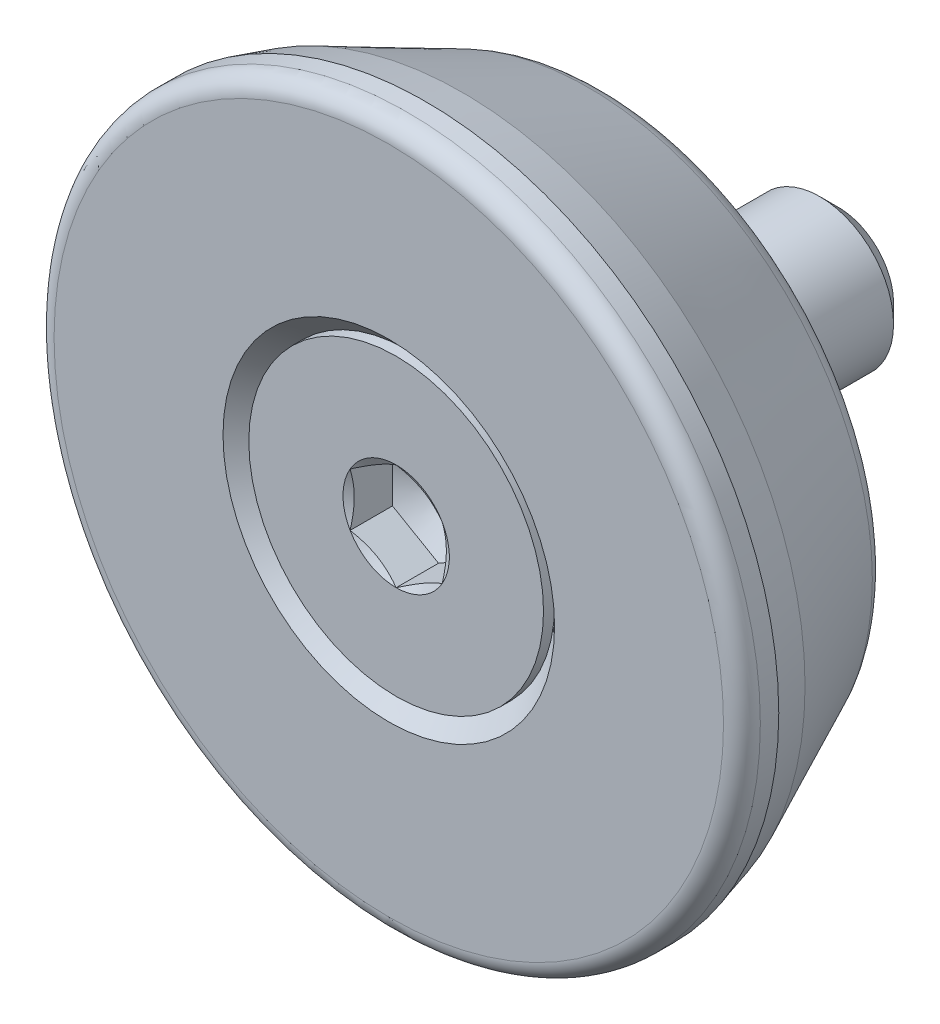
ISO-10303-21;
HEADER;
FILE_DESCRIPTION(('STEP AP214'),'2;1');
FILE_NAME('part.step','',(''),(''),'','','');
FILE_SCHEMA(('AUTOMOTIVE_DESIGN { 1 0 10303 214 1 1 1 1 }'));
ENDSEC;
DATA;
#1=APPLICATION_CONTEXT('core data for automotive mechanical design processes');
#2=APPLICATION_PROTOCOL_DEFINITION('international standard','automotive_design',2000,#1);
#3=PRODUCT_CONTEXT('',#1,'mechanical');
#4=PRODUCT('Part','Part','',(#3));
#5=PRODUCT_RELATED_PRODUCT_CATEGORY('part','',(#4));
#6=PRODUCT_DEFINITION_FORMATION('','',#4);
#7=PRODUCT_DEFINITION_CONTEXT('part definition',#1,'design');
#8=PRODUCT_DEFINITION('design','',#6,#7);
#9=PRODUCT_DEFINITION_SHAPE('','',#8);
#10=(LENGTH_UNIT() NAMED_UNIT(*) SI_UNIT(.MILLI.,.METRE.));
#11=(NAMED_UNIT(*) PLANE_ANGLE_UNIT() SI_UNIT($,.RADIAN.));
#12=(NAMED_UNIT(*) SI_UNIT($,.STERADIAN.) SOLID_ANGLE_UNIT());
#13=UNCERTAINTY_MEASURE_WITH_UNIT(LENGTH_MEASURE(1.E-05),#10,'distance_accuracy_value','');
#14=(GEOMETRIC_REPRESENTATION_CONTEXT(3) GLOBAL_UNCERTAINTY_ASSIGNED_CONTEXT((#13)) GLOBAL_UNIT_ASSIGNED_CONTEXT((#10,
#11,#12)) REPRESENTATION_CONTEXT('',''));
#15=CARTESIAN_POINT('',(0.,0.,0.));
#16=DIRECTION('',(0.,0.,1.));
#17=DIRECTION('',(1.,0.,0.));
#18=AXIS2_PLACEMENT_3D('',#15,#16,#17);
#19=CARTESIAN_POINT('',(0.,0.,-1.45));
#20=DIRECTION('',(0.,0.,1.));
#21=DIRECTION('',(1.,0.,0.));
#22=AXIS2_PLACEMENT_3D('',#19,#20,#21);
#23=CONICAL_SURFACE('',#22,9.585,0.279252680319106);
#24=CARTESIAN_POINT('',(0.,0.,-2.45));
#25=DIRECTION('',(0.,0.,1.));
#26=DIRECTION('',(1.,0.,0.));
#27=AXIS2_PLACEMENT_3D('',#24,#25,#26);
#28=CIRCLE('',#27,9.29825461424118);
#29=CARTESIAN_POINT('',(9.29825461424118,0.,-2.45));
#30=VERTEX_POINT('',#29);
#31=EDGE_CURVE('E825',#30,#30,#28,.T.);
#32=ORIENTED_EDGE('',*,*,#31,.T.);
#33=EDGE_LOOP('',(#32));
#34=FACE_BOUND('',#33,.T.);
#35=CARTESIAN_POINT('',(0.,0.,-1.45));
#36=DIRECTION('',(0.,0.,1.));
#37=DIRECTION('',(1.,0.,0.));
#38=AXIS2_PLACEMENT_3D('',#35,#36,#37);
#39=CIRCLE('',#38,9.585);
#40=CARTESIAN_POINT('',(9.585,0.,-1.45));
#41=VERTEX_POINT('',#40);
#42=EDGE_CURVE('E827',#41,#41,#39,.T.);
#43=ORIENTED_EDGE('',*,*,#42,.F.);
#44=EDGE_LOOP('',(#43));
#45=FACE_BOUND('',#44,.T.);
#46=ADVANCED_FACE('F14',(#34,#45),#23,.T.);
#47=CARTESIAN_POINT('',(0.,0.,-2.45));
#48=DIRECTION('',(0.,0.,1.));
#49=DIRECTION('',(1.,0.,0.));
#50=AXIS2_PLACEMENT_3D('',#47,#48,#49);
#51=CONICAL_SURFACE('',#50,9.29825461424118,0.436332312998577);
#52=CARTESIAN_POINT('',(0.,0.,-5.8726182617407));
#53=DIRECTION('',(0.,0.,-1.));
#54=DIRECTION('',(-1.,0.,0.));
#55=AXIS2_PLACEMENT_3D('',#52,#53,#54);
#56=CIRCLE('',#55,7.70226150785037);
#57=CARTESIAN_POINT('',(-7.70226150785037,0.,-5.8726182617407));
#58=VERTEX_POINT('',#57);
#59=EDGE_CURVE('E830',#58,#58,#56,.F.);
#60=ORIENTED_EDGE('',*,*,#59,.T.);
#61=EDGE_LOOP('',(#60));
#62=FACE_BOUND('',#61,.T.);
#63=ORIENTED_EDGE('',*,*,#31,.F.);
#64=EDGE_LOOP('',(#63));
#65=FACE_BOUND('',#64,.T.);
#66=ADVANCED_FACE('F651',(#62,#65),#51,.T.);
#67=CARTESIAN_POINT('',(0.,0.,-5.45));
#68=DIRECTION('',(0.,0.,-1.));
#69=DIRECTION('',(-1.,0.,0.));
#70=AXIS2_PLACEMENT_3D('',#67,#68,#69);
#71=TOROIDAL_SURFACE('',#70,6.79595372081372,1.);
#72=CARTESIAN_POINT('',(0.,0.,-6.45));
#73=DIRECTION('',(0.,0.,-1.));
#74=DIRECTION('',(-1.,0.,0.));
#75=AXIS2_PLACEMENT_3D('',#72,#73,#74);
#76=CIRCLE('',#75,6.79595372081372);
#77=CARTESIAN_POINT('',(-6.79595372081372,0.,-6.45));
#78=VERTEX_POINT('',#77);
#79=EDGE_CURVE('E833',#78,#78,#76,.T.);
#80=ORIENTED_EDGE('',*,*,#79,.F.);
#81=EDGE_LOOP('',(#80));
#82=FACE_BOUND('',#81,.T.);
#83=ORIENTED_EDGE('',*,*,#59,.F.);
#84=EDGE_LOOP('',(#83));
#85=FACE_BOUND('',#84,.T.);
#86=ADVANCED_FACE('F658',(#82,#85),#71,.T.);
#87=CARTESIAN_POINT('',(7.43302398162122,0.,-6.45));
#88=DIRECTION('',(0.,0.,-1.));
#89=DIRECTION('',(-1.,0.,0.));
#90=AXIS2_PLACEMENT_3D('',#87,#88,#89);
#91=PLANE('',#90);
#92=ORIENTED_EDGE('',*,*,#79,.T.);
#93=EDGE_LOOP('',(#92));
#94=FACE_BOUND('',#93,.T.);
#95=CARTESIAN_POINT('',(0.,0.,-6.45));
#96=DIRECTION('',(0.,0.,1.));
#97=DIRECTION('',(1.,0.,0.));
#98=AXIS2_PLACEMENT_3D('',#95,#96,#97);
#99=CIRCLE('',#98,5.);
#100=CARTESIAN_POINT('',(5.,0.,-6.45));
#101=VERTEX_POINT('',#100);
#102=EDGE_CURVE('E9',#101,#101,#99,.T.);
#103=ORIENTED_EDGE('',*,*,#102,.T.);
#104=EDGE_LOOP('',(#103));
#105=FACE_BOUND('',#104,.T.);
#106=ADVANCED_FACE('F669',(#94,#105),#91,.T.);
#107=CARTESIAN_POINT('',(0.,0.,0.));
#108=DIRECTION('',(0.,0.,1.));
#109=DIRECTION('',(1.,0.,0.));
#110=AXIS2_PLACEMENT_3D('',#107,#108,#109);
#111=CYLINDRICAL_SURFACE('',#110,9.585);
#112=CARTESIAN_POINT('',(0.,0.,-0.95));
#113=DIRECTION('',(0.,0.,1.));
#114=DIRECTION('',(1.,0.,0.));
#115=AXIS2_PLACEMENT_3D('',#112,#113,#114);
#116=CIRCLE('',#115,9.585);
#117=CARTESIAN_POINT('',(9.585,0.,-0.949999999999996));
#118=VERTEX_POINT('',#117);
#119=EDGE_CURVE('E513',#118,#118,#116,.F.);
#120=ORIENTED_EDGE('',*,*,#119,.T.);
#121=EDGE_LOOP('',(#120));
#122=FACE_BOUND('',#121,.T.);
#123=ORIENTED_EDGE('',*,*,#42,.T.);
#124=EDGE_LOOP('',(#123));
#125=FACE_BOUND('',#124,.T.);
#126=ADVANCED_FACE('F665',(#122,#125),#111,.T.);
#127=CARTESIAN_POINT('',(0.,0.,-0.95));
#128=DIRECTION('',(0.,0.,1.));
#129=DIRECTION('',(1.,0.,0.));
#130=AXIS2_PLACEMENT_3D('',#127,#128,#129);
#131=TOROIDAL_SURFACE('',#130,9.085,0.5);
#132=ORIENTED_EDGE('',*,*,#119,.F.);
#133=EDGE_LOOP('',(#132));
#134=FACE_BOUND('',#133,.T.);
#135=CARTESIAN_POINT('',(0.,0.,-0.45));
#136=DIRECTION('',(0.,0.,1.));
#137=DIRECTION('',(1.,0.,0.));
#138=AXIS2_PLACEMENT_3D('',#135,#136,#137);
#139=CIRCLE('',#138,9.085);
#140=CARTESIAN_POINT('',(9.085,0.,-0.449999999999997));
#141=VERTEX_POINT('',#140);
#142=EDGE_CURVE('E836',#141,#141,#139,.T.);
#143=ORIENTED_EDGE('',*,*,#142,.F.);
#144=EDGE_LOOP('',(#143));
#145=FACE_BOUND('',#144,.T.);
#146=ADVANCED_FACE('F668',(#134,#145),#131,.T.);
#147=CARTESIAN_POINT('',(9.585,0.,-0.45));
#148=DIRECTION('',(0.,0.,1.));
#149=DIRECTION('',(1.,0.,0.));
#150=AXIS2_PLACEMENT_3D('',#147,#148,#149);
#151=PLANE('',#150);
#152=CARTESIAN_POINT('',(0.,0.,-0.45));
#153=DIRECTION('',(0.,0.,1.));
#154=DIRECTION('',(1.,0.,0.));
#155=AXIS2_PLACEMENT_3D('',#152,#153,#154);
#156=CIRCLE('',#155,4.5);
#157=CARTESIAN_POINT('',(4.5,0.,-0.45));
#158=VERTEX_POINT('',#157);
#159=EDGE_CURVE('E813',#158,#158,#156,.T.);
#160=ORIENTED_EDGE('',*,*,#159,.F.);
#161=EDGE_LOOP('',(#160));
#162=FACE_BOUND('',#161,.T.);
#163=ORIENTED_EDGE('',*,*,#142,.T.);
#164=EDGE_LOOP('',(#163));
#165=FACE_BOUND('',#164,.T.);
#166=ADVANCED_FACE('F671',(#162,#165),#151,.T.);
#167=CARTESIAN_POINT('',(0.,0.,-0.45));
#168=DIRECTION('',(0.,0.,1.));
#169=DIRECTION('',(1.,0.,0.));
#170=AXIS2_PLACEMENT_3D('',#167,#168,#169);
#171=CONICAL_SURFACE('',#170,4.5,0.785398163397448);
#172=CARTESIAN_POINT('',(0.,0.,-0.950000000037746));
#173=DIRECTION('',(0.,0.,1.));
#174=DIRECTION('',(0.,1.,0.));
#175=AXIS2_PLACEMENT_3D('',#172,#173,#174);
#176=CIRCLE('',#175,3.99999999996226);
#177=CARTESIAN_POINT('',(0.,3.99999999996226,-0.950000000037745));
#178=VERTEX_POINT('',#177);
#179=EDGE_CURVE('E509',#178,#178,#176,.F.);
#180=ORIENTED_EDGE('',*,*,#179,.T.);
#181=EDGE_LOOP('',(#180));
#182=FACE_BOUND('',#181,.T.);
#183=ORIENTED_EDGE('',*,*,#159,.T.);
#184=EDGE_LOOP('',(#183));
#185=FACE_BOUND('',#184,.T.);
#186=ADVANCED_FACE('F674',(#182,#185),#171,.F.);
#187=CARTESIAN_POINT('',(0.,0.,-6.45));
#188=DIRECTION('',(0.,0.,1.));
#189=DIRECTION('',(1.,0.,0.));
#190=AXIS2_PLACEMENT_3D('',#187,#188,#189);
#191=CIRCLE('',#190,2.84185842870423);
#192=CARTESIAN_POINT('',(2.46392749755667,-1.41605812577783,-6.45));
#193=VERTEX_POINT('',#192);
#194=CARTESIAN_POINT('',(2.46392749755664,1.41605812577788,-6.45));
#195=VERTEX_POINT('',#194);
#196=EDGE_CURVE('E24',#193,#195,#191,.T.);
#197=ORIENTED_EDGE('',*,*,#196,.F.);
#198=DIRECTION('',(-0.829037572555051,0.559192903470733,0.));
#199=VECTOR('',#198,1.);
#200=CARTESIAN_POINT('',(5.22273077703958,-3.2768944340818,-6.45));
#201=LINE('',#200,#199);
#202=CARTESIAN_POINT('',(2.53073683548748,-1.46112159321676,-6.45));
#203=VERTEX_POINT('',#202);
#204=EDGE_CURVE('E384',#203,#193,#201,.T.);
#205=ORIENTED_EDGE('',*,*,#204,.F.);
#206=DIRECTION('',(-0.898794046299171,0.438371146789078,0.));
#207=VECTOR('',#206,1.);
#208=CARTESIAN_POINT('',(2.53073683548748,-1.46112159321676,-6.45));
#209=LINE('',#208,#207);
#210=CARTESIAN_POINT('',(2.45830605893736,-1.42579474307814,-6.45));
#211=VERTEX_POINT('',#210);
#212=EDGE_CURVE('E381',#203,#211,#209,.T.);
#213=ORIENTED_EDGE('',*,*,#212,.T.);
#214=CARTESIAN_POINT('',(0.,0.,-6.45));
#215=DIRECTION('',(0.,0.,-1.));
#216=DIRECTION('',(-1.,0.,0.));
#217=AXIS2_PLACEMENT_3D('',#214,#215,#216);
#218=CIRCLE('',#217,2.84185842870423);
#219=CARTESIAN_POINT('',(0.00562143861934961,-2.84185286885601,-6.45));
#220=VERTEX_POINT('',#219);
#221=EDGE_CURVE('E383',#220,#211,#218,.F.);
#222=ORIENTED_EDGE('',*,*,#221,.F.);
#223=DIRECTION('',(0.0697564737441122,0.997564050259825,0.));
#224=VECTOR('',#223,1.);
#225=CARTESIAN_POINT('',(0.239517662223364,0.503018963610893,-6.45));
#226=LINE('',#225,#224);
#227=CARTESIAN_POINT('',(0.,-2.92224318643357,-6.45));
#228=VERTEX_POINT('',#227);
#229=EDGE_CURVE('E459',#228,#220,#226,.T.);
#230=ORIENTED_EDGE('',*,*,#229,.F.);
#231=DIRECTION('',(-0.0697564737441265,0.997564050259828,0.));
#232=VECTOR('',#231,1.);
#233=CARTESIAN_POINT('',(0.,-2.92224318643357,-6.45));
#234=LINE('',#233,#232);
#235=CARTESIAN_POINT('',(-0.00562143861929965,-2.84185286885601,-6.45));
#236=VERTEX_POINT('',#235);
#237=EDGE_CURVE('E421',#228,#236,#234,.T.);
#238=ORIENTED_EDGE('',*,*,#237,.T.);
#239=CARTESIAN_POINT('',(0.,0.,-6.45));
#240=DIRECTION('',(0.,0.,-1.));
#241=DIRECTION('',(-1.,0.,0.));
#242=AXIS2_PLACEMENT_3D('',#239,#240,#241);
#243=CIRCLE('',#242,2.84185842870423);
#244=CARTESIAN_POINT('',(-2.45830605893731,-1.42579474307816,-6.45));
#245=VERTEX_POINT('',#244);
#246=EDGE_CURVE('E465',#245,#236,#243,.F.);
#247=ORIENTED_EDGE('',*,*,#246,.F.);
#248=DIRECTION('',(0.898794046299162,0.438371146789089,0.));
#249=VECTOR('',#248,1.);
#250=CARTESIAN_POINT('',(6.09398517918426,2.74543640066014,-6.45));
#251=LINE('',#250,#249);
#252=CARTESIAN_POINT('',(-2.53073683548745,-1.4611215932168,-6.45));
#253=VERTEX_POINT('',#252);
#254=EDGE_CURVE('E851',#253,#245,#251,.T.);
#255=ORIENTED_EDGE('',*,*,#254,.F.);
#256=DIRECTION('',(0.829037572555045,0.559192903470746,0.));
#257=VECTOR('',#256,1.);
#258=CARTESIAN_POINT('',(-2.53073683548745,-1.4611215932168,-6.45));
#259=LINE('',#258,#257);
#260=CARTESIAN_POINT('',(-2.46392749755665,-1.41605812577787,-6.45));
#261=VERTEX_POINT('',#260);
#262=EDGE_CURVE('E467',#253,#261,#259,.T.);
#263=ORIENTED_EDGE('',*,*,#262,.T.);
#264=CARTESIAN_POINT('',(0.,0.,-6.45));
#265=DIRECTION('',(0.,0.,-1.));
#266=DIRECTION('',(-1.,0.,0.));
#267=AXIS2_PLACEMENT_3D('',#264,#265,#266);
#268=CIRCLE('',#267,2.84185842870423);
#269=CARTESIAN_POINT('',(-2.46392749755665,1.41605812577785,-6.45));
#270=VERTEX_POINT('',#269);
#271=EDGE_CURVE('E463',#270,#261,#268,.F.);
#272=ORIENTED_EDGE('',*,*,#271,.F.);
#273=DIRECTION('',(0.829037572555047,-0.559192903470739,0.));
#274=VECTOR('',#273,1.);
#275=CARTESIAN_POINT('',(4.99475299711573,-3.61488539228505,-6.45));
#276=LINE('',#275,#274);
#277=CARTESIAN_POINT('',(-2.53073683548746,1.46112159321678,-6.45));
#278=VERTEX_POINT('',#277);
#279=EDGE_CURVE('E845',#278,#270,#276,.T.);
#280=ORIENTED_EDGE('',*,*,#279,.F.);
#281=DIRECTION('',(0.898794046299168,-0.438371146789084,0.));
#282=VECTOR('',#281,1.);
#283=CARTESIAN_POINT('',(-2.53073683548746,1.46112159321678,-6.45));
#284=LINE('',#283,#282);
#285=CARTESIAN_POINT('',(-2.45830605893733,1.42579474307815,-6.45));
#286=VERTEX_POINT('',#285);
#287=EDGE_CURVE('E848',#278,#286,#284,.T.);
#288=ORIENTED_EDGE('',*,*,#287,.T.);
#289=CARTESIAN_POINT('',(0.,0.,-6.45));
#290=DIRECTION('',(0.,0.,-1.));
#291=DIRECTION('',(-1.,0.,0.));
#292=AXIS2_PLACEMENT_3D('',#289,#290,#291);
#293=CIRCLE('',#292,2.84185842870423);
#294=CARTESIAN_POINT('',(-0.00562143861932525,2.84185286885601,-6.45));
#295=VERTEX_POINT('',#294);
#296=EDGE_CURVE('E849',#295,#286,#293,.F.);
#297=ORIENTED_EDGE('',*,*,#296,.F.);
#298=DIRECTION('',(-0.0697564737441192,-0.997564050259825,0.));
#299=VECTOR('',#298,1.);
#300=CARTESIAN_POINT('',(-0.167179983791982,0.531458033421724,-6.45));
#301=LINE('',#300,#299);
#302=CARTESIAN_POINT('',(0.,2.92224318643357,-6.45));
#303=VERTEX_POINT('',#302);
#304=EDGE_CURVE('E512',#303,#295,#301,.T.);
#305=ORIENTED_EDGE('',*,*,#304,.F.);
#306=DIRECTION('',(0.0697564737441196,-0.997564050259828,0.));
#307=VECTOR('',#306,1.);
#308=CARTESIAN_POINT('',(0.,2.92224318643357,-6.45));
#309=LINE('',#308,#307);
#310=CARTESIAN_POINT('',(0.00562143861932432,2.84185286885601,-6.45));
#311=VERTEX_POINT('',#310);
#312=EDGE_CURVE('E214',#303,#311,#309,.T.);
#313=ORIENTED_EDGE('',*,*,#312,.T.);
#314=CARTESIAN_POINT('',(0.,0.,-6.45));
#315=DIRECTION('',(0.,0.,-1.));
#316=DIRECTION('',(-1.,0.,0.));
#317=AXIS2_PLACEMENT_3D('',#314,#315,#316);
#318=CIRCLE('',#317,2.84185842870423);
#319=CARTESIAN_POINT('',(2.45830605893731,1.42579474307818,-6.45));
#320=VERTEX_POINT('',#319);
#321=EDGE_CURVE('E842',#320,#311,#318,.F.);
#322=ORIENTED_EDGE('',*,*,#321,.F.);
#323=DIRECTION('',(-0.898794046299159,-0.438371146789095,0.));
#324=VECTOR('',#323,1.);
#325=CARTESIAN_POINT('',(5.91526531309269,3.11186642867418,-6.45));
#326=LINE('',#325,#324);
#327=CARTESIAN_POINT('',(2.53073683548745,1.46112159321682,-6.45));
#328=VERTEX_POINT('',#327);
#329=EDGE_CURVE('E475',#328,#320,#326,.T.);
#330=ORIENTED_EDGE('',*,*,#329,.F.);
#331=DIRECTION('',(0.829037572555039,0.559192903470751,0.));
#332=VECTOR('',#331,1.);
#333=CARTESIAN_POINT('',(5.22273077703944,3.27689443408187,-6.45));
#334=LINE('',#333,#332);
#335=EDGE_CURVE('E33',#195,#328,#334,.T.);
#336=ORIENTED_EDGE('',*,*,#335,.F.);
#337=EDGE_LOOP('',(#197,#205,#213,#222,#230,#238,#247,#255,#263,#272,#280,#288,#297,#305,#313,
#322,#330,#336));
#338=FACE_BOUND('',#337,.T.);
#339=CARTESIAN_POINT('',(0.,0.,-6.45));
#340=DIRECTION('',(0.,0.,1.));
#341=DIRECTION('',(1.,0.,0.));
#342=AXIS2_PLACEMENT_3D('',#339,#340,#341);
#343=CIRCLE('',#342,2.15);
#344=CARTESIAN_POINT('',(2.15,0.,-6.45));
#345=VERTEX_POINT('',#344);
#346=EDGE_CURVE('E820',#345,#345,#343,.T.);
#347=ORIENTED_EDGE('',*,*,#346,.T.);
#348=EDGE_LOOP('',(#347));
#349=FACE_BOUND('',#348,.T.);
#350=ADVANCED_FACE('F908',(#338,#349),#91,.T.);
#351=CARTESIAN_POINT('',(0.,0.,-0.45));
#352=DIRECTION('',(0.,0.,1.));
#353=DIRECTION('',(1.,0.,0.));
#354=AXIS2_PLACEMENT_3D('',#351,#352,#353);
#355=CYLINDRICAL_SURFACE('',#354,2.15);
#356=ORIENTED_EDGE('',*,*,#346,.F.);
#357=EDGE_LOOP('',(#356));
#358=FACE_BOUND('',#357,.T.);
#359=CARTESIAN_POINT('',(0.,0.,-2.8));
#360=DIRECTION('',(0.,0.,1.));
#361=DIRECTION('',(1.,0.,0.));
#362=AXIS2_PLACEMENT_3D('',#359,#360,#361);
#363=CIRCLE('',#362,2.15);
#364=CARTESIAN_POINT('',(2.15,0.,-2.8));
#365=VERTEX_POINT('',#364);
#366=EDGE_CURVE('E815',#365,#365,#363,.T.);
#367=ORIENTED_EDGE('',*,*,#366,.T.);
#368=EDGE_LOOP('',(#367));
#369=FACE_BOUND('',#368,.T.);
#370=ADVANCED_FACE('F690',(#358,#369),#355,.F.);
#371=CARTESIAN_POINT('',(0.,0.,-1.80000000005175));
#372=DIRECTION('',(0.,0.,1.));
#373=DIRECTION('',(0.,1.,0.));
#374=AXIS2_PLACEMENT_3D('',#371,#372,#373);
#375=CONICAL_SURFACE('',#374,1.44337567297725,1.04719755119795);
#376=CARTESIAN_POINT('',(0.,0.,-1.80000000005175));
#377=DIRECTION('',(0.,0.,1.));
#378=DIRECTION('',(0.,1.,0.));
#379=AXIS2_PLACEMENT_3D('',#376,#377,#378);
#380=CIRCLE('',#379,1.44337567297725);
#381=CARTESIAN_POINT('',(-1.25000000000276,-0.721687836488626,-1.80000000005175));
#382=VERTEX_POINT('',#381);
#383=CARTESIAN_POINT('',(-6.50028549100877E-12,-1.44337567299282,-1.80000000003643));
#384=VERTEX_POINT('',#383);
#385=EDGE_CURVE('E516',#382,#384,#380,.T.);
#386=ORIENTED_EDGE('',*,*,#385,.T.);
#387=CARTESIAN_POINT('',(0.,0.,-1.80000000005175));
#388=DIRECTION('',(0.,0.,1.));
#389=DIRECTION('',(0.,1.,0.));
#390=AXIS2_PLACEMENT_3D('',#387,#388,#389);
#391=CIRCLE('',#390,1.44337567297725);
#392=CARTESIAN_POINT('',(1.25000000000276,-0.721687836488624,-1.80000000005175));
#393=VERTEX_POINT('',#392);
#394=EDGE_CURVE('E718',#384,#393,#391,.T.);
#395=ORIENTED_EDGE('',*,*,#394,.T.);
#396=CARTESIAN_POINT('',(0.,0.,-1.80000000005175));
#397=DIRECTION('',(0.,0.,1.));
#398=DIRECTION('',(0.,1.,0.));
#399=AXIS2_PLACEMENT_3D('',#396,#397,#398);
#400=CIRCLE('',#399,1.44337567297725);
#401=CARTESIAN_POINT('',(1.25000000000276,0.721687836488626,-1.80000000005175));
#402=VERTEX_POINT('',#401);
#403=EDGE_CURVE('E720',#393,#402,#400,.T.);
#404=ORIENTED_EDGE('',*,*,#403,.T.);
#405=CARTESIAN_POINT('',(0.,0.,-1.80000000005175));
#406=DIRECTION('',(0.,0.,1.));
#407=DIRECTION('',(0.,1.,0.));
#408=AXIS2_PLACEMENT_3D('',#405,#406,#407);
#409=CIRCLE('',#408,1.44337567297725);
#410=CARTESIAN_POINT('',(0.,1.44337567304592,-1.79999999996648));
#411=VERTEX_POINT('',#410);
#412=EDGE_CURVE('E750',#402,#411,#409,.T.);
#413=ORIENTED_EDGE('',*,*,#412,.T.);
#414=CARTESIAN_POINT('',(0.,0.,-1.80000000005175));
#415=DIRECTION('',(0.,0.,1.));
#416=DIRECTION('',(0.,1.,0.));
#417=AXIS2_PLACEMENT_3D('',#414,#415,#416);
#418=CIRCLE('',#417,1.44337567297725);
#419=CARTESIAN_POINT('',(-1.25000000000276,0.721687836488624,-1.80000000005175));
#420=VERTEX_POINT('',#419);
#421=EDGE_CURVE('E747',#411,#420,#418,.T.);
#422=ORIENTED_EDGE('',*,*,#421,.T.);
#423=CARTESIAN_POINT('',(0.,0.,-1.80000000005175));
#424=DIRECTION('',(0.,0.,1.));
#425=DIRECTION('',(0.,1.,0.));
#426=AXIS2_PLACEMENT_3D('',#423,#424,#425);
#427=CIRCLE('',#426,1.44337567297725);
#428=EDGE_CURVE('E219',#420,#382,#427,.T.);
#429=ORIENTED_EDGE('',*,*,#428,.T.);
#430=EDGE_LOOP('',(#386,#395,#404,#413,#422,#429));
#431=FACE_BOUND('',#430,.T.);
#432=CARTESIAN_POINT('',(0.,-1.421083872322E-10,-2.63333333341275));
#433=VERTEX_POINT('',#432);
#434=VERTEX_LOOP('',#433);
#435=FACE_BOUND('',#434,.T.);
#436=ADVANCED_FACE('F686',(#431,#435),#375,.F.);
#437=CARTESIAN_POINT('',(0.,0.,-1.8000000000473));
#438=DIRECTION('',(0.,0.,1.));
#439=DIRECTION('',(0.,1.,0.));
#440=AXIS2_PLACEMENT_3D('',#437,#438,#439);
#441=PLANE('',#440);
#442=ORIENTED_EDGE('',*,*,#403,.F.);
#443=DIRECTION('',(0.,1.,0.));
#444=VECTOR('',#443,1.);
#445=CARTESIAN_POINT('',(1.25,-0.721687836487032,-1.8000000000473));
#446=LINE('',#445,#444);
#447=EDGE_CURVE('E491',#402,#393,#446,.F.);
#448=ORIENTED_EDGE('',*,*,#447,.F.);
#449=EDGE_LOOP('',(#442,#448));
#450=FACE_BOUND('',#449,.T.);
#451=ADVANCED_FACE('F689',(#450),#441,.F.);
#452=CARTESIAN_POINT('',(0.,0.,-1.8000000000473));
#453=DIRECTION('',(0.,0.,1.));
#454=DIRECTION('',(0.,1.,0.));
#455=AXIS2_PLACEMENT_3D('',#452,#453,#454);
#456=PLANE('',#455);
#457=ORIENTED_EDGE('',*,*,#412,.F.);
#458=DIRECTION('',(-0.866025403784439,0.5,0.));
#459=VECTOR('',#458,1.);
#460=CARTESIAN_POINT('',(1.25,0.721687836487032,-1.80000000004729));
#461=LINE('',#460,#459);
#462=EDGE_CURVE('E487',#411,#402,#461,.F.);
#463=ORIENTED_EDGE('',*,*,#462,.F.);
#464=EDGE_LOOP('',(#457,#463));
#465=FACE_BOUND('',#464,.T.);
#466=ADVANCED_FACE('F699',(#465),#456,.F.);
#467=CARTESIAN_POINT('',(0.,0.,-1.8000000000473));
#468=DIRECTION('',(0.,0.,1.));
#469=DIRECTION('',(0.,1.,0.));
#470=AXIS2_PLACEMENT_3D('',#467,#468,#469);
#471=PLANE('',#470);
#472=ORIENTED_EDGE('',*,*,#421,.F.);
#473=DIRECTION('',(-0.866025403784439,-0.5,0.));
#474=VECTOR('',#473,1.);
#475=CARTESIAN_POINT('',(0.,1.44337567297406,-1.80000000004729));
#476=LINE('',#475,#474);
#477=EDGE_CURVE('E482',#420,#411,#476,.F.);
#478=ORIENTED_EDGE('',*,*,#477,.F.);
#479=EDGE_LOOP('',(#472,#478));
#480=FACE_BOUND('',#479,.T.);
#481=ADVANCED_FACE('F695',(#480),#471,.F.);
#482=CARTESIAN_POINT('',(0.,0.,-1.8000000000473));
#483=DIRECTION('',(0.,0.,1.));
#484=DIRECTION('',(0.,1.,0.));
#485=AXIS2_PLACEMENT_3D('',#482,#483,#484);
#486=PLANE('',#485);
#487=ORIENTED_EDGE('',*,*,#428,.F.);
#488=DIRECTION('',(0.,1.,0.));
#489=VECTOR('',#488,1.);
#490=CARTESIAN_POINT('',(-1.25,0.721687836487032,-1.80000000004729));
#491=LINE('',#490,#489);
#492=EDGE_CURVE('E483',#382,#420,#491,.T.);
#493=ORIENTED_EDGE('',*,*,#492,.F.);
#494=EDGE_LOOP('',(#487,#493));
#495=FACE_BOUND('',#494,.T.);
#496=ADVANCED_FACE('F692',(#495),#486,.F.);
#497=CARTESIAN_POINT('',(0.,0.,-1.8000000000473));
#498=DIRECTION('',(0.,0.,1.));
#499=DIRECTION('',(0.,1.,0.));
#500=AXIS2_PLACEMENT_3D('',#497,#498,#499);
#501=PLANE('',#500);
#502=ORIENTED_EDGE('',*,*,#385,.F.);
#503=DIRECTION('',(0.866025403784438,-0.5,0.));
#504=VECTOR('',#503,1.);
#505=CARTESIAN_POINT('',(-1.25,-0.721687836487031,-1.8000000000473));
#506=LINE('',#505,#504);
#507=EDGE_CURVE('E500',#384,#382,#506,.F.);
#508=ORIENTED_EDGE('',*,*,#507,.F.);
#509=EDGE_LOOP('',(#502,#508));
#510=FACE_BOUND('',#509,.T.);
#511=ADVANCED_FACE('F605',(#510),#501,.F.);
#512=CARTESIAN_POINT('',(0.,0.,-1.8000000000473));
#513=DIRECTION('',(0.,0.,1.));
#514=DIRECTION('',(0.,1.,0.));
#515=AXIS2_PLACEMENT_3D('',#512,#513,#514);
#516=PLANE('',#515);
#517=ORIENTED_EDGE('',*,*,#394,.F.);
#518=DIRECTION('',(0.866025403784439,0.5,0.));
#519=VECTOR('',#518,1.);
#520=CARTESIAN_POINT('',(0.,-1.44337567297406,-1.8000000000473));
#521=LINE('',#520,#519);
#522=EDGE_CURVE('E495',#393,#384,#521,.F.);
#523=ORIENTED_EDGE('',*,*,#522,.F.);
#524=EDGE_LOOP('',(#517,#523));
#525=FACE_BOUND('',#524,.T.);
#526=ADVANCED_FACE('F706',(#525),#516,.F.);
#527=CARTESIAN_POINT('',(1.25,-0.721687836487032,-2.95000000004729));
#528=DIRECTION('',(-1.,0.,0.));
#529=DIRECTION('',(0.,1.,0.));
#530=AXIS2_PLACEMENT_3D('',#527,#528,#529);
#531=PLANE('',#530);
#532=DIRECTION('',(0.,0.,-1.));
#533=VECTOR('',#532,1.);
#534=CARTESIAN_POINT('',(1.25,-0.721687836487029,-2.95000000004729));
#535=LINE('',#534,#533);
#536=CARTESIAN_POINT('',(1.25000000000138,-0.721687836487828,-0.650000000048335));
#537=VERTEX_POINT('',#536);
#538=EDGE_CURVE('E492',#537,#393,#535,.T.);
#539=ORIENTED_EDGE('',*,*,#538,.F.);
#540=CARTESIAN_POINT('',(1.25,-0.721687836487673,-0.650000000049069));
#541=CARTESIAN_POINT('',(1.25,-0.662444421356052,-0.667103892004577));
#542=CARTESIAN_POINT('',(1.25,-0.602732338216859,-0.68276298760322));
#543=CARTESIAN_POINT('',(1.25,-0.482338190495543,-0.710438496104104));
#544=CARTESIAN_POINT('',(1.25,-0.421654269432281,-0.722446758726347));
#545=CARTESIAN_POINT('',(1.25,-0.300967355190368,-0.74175749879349));
#546=CARTESIAN_POINT('',(1.25,-0.240981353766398,-0.749162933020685));
#547=CARTESIAN_POINT('',(1.25,-0.120663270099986,-0.759104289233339));
#548=CARTESIAN_POINT('',(1.25,-0.0603316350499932,-0.761645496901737));
#549=CARTESIAN_POINT('',(1.25,0.060331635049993,-0.761645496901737));
#550=CARTESIAN_POINT('',(1.25,0.120663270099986,-0.759104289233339));
#551=CARTESIAN_POINT('',(1.25,0.240981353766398,-0.749162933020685));
#552=CARTESIAN_POINT('',(1.25,0.300967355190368,-0.74175749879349));
#553=CARTESIAN_POINT('',(1.25,0.421654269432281,-0.722446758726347));
#554=CARTESIAN_POINT('',(1.25,0.482338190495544,-0.710438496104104));
#555=CARTESIAN_POINT('',(1.25,0.60273233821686,-0.68276298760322));
#556=CARTESIAN_POINT('',(1.25,0.662444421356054,-0.667103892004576));
#557=CARTESIAN_POINT('',(1.25,0.721687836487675,-0.650000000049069));
#558=B_SPLINE_CURVE_WITH_KNOTS('',3,(#540,#541,#542,#543,#544,#545,#546,#547,#548,#549,#550,
#551,#552,#553,#554,#555,#556,#557),.UNSPECIFIED.,.F.,.F.,(4,2,2,2,2,2,2,2,4),(0.,
0.185045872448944,0.370501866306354,0.551644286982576,0.732589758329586,0.913535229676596,
1.09467765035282,1.28013364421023,1.46517951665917),.UNSPECIFIED.);
#559=CARTESIAN_POINT('',(1.25000000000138,0.72168783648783,-0.650000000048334));
#560=VERTEX_POINT('',#559);
#561=EDGE_CURVE('E622',#537,#560,#558,.T.);
#562=ORIENTED_EDGE('',*,*,#561,.T.);
#563=DIRECTION('',(0.,0.,-1.));
#564=VECTOR('',#563,1.);
#565=CARTESIAN_POINT('',(1.25,0.721687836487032,-2.95000000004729));
#566=LINE('',#565,#564);
#567=EDGE_CURVE('E488',#560,#402,#566,.T.);
#568=ORIENTED_EDGE('',*,*,#567,.T.);
#569=ORIENTED_EDGE('',*,*,#447,.T.);
#570=EDGE_LOOP('',(#539,#562,#568,#569));
#571=FACE_BOUND('',#570,.T.);
#572=ADVANCED_FACE('F614',(#571),#531,.T.);
#573=CARTESIAN_POINT('',(1.25,0.721687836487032,-2.95000000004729));
#574=DIRECTION('',(-0.5,-0.866025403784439,0.));
#575=DIRECTION('',(-0.866025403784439,0.5,0.));
#576=AXIS2_PLACEMENT_3D('',#573,#574,#575);
#577=PLANE('',#576);
#578=ORIENTED_EDGE('',*,*,#462,.T.);
#579=ORIENTED_EDGE('',*,*,#567,.F.);
#580=CARTESIAN_POINT('',(1.25000000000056,0.721687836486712,-0.650000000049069));
#581=CARTESIAN_POINT('',(1.19869369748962,0.751309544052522,-0.667103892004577));
#582=CARTESIAN_POINT('',(1.14698151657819,0.781165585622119,-0.68276298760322));
#583=CARTESIAN_POINT('',(1.04271712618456,0.841362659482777,-0.710438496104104));
#584=CARTESIAN_POINT('',(0.990163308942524,0.871704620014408,-0.722446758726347));
#585=CARTESIAN_POINT('',(0.885645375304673,0.932048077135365,-0.741757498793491));
#586=CARTESIAN_POINT('',(0.833695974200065,0.96204107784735,-0.749162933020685));
#587=CARTESIAN_POINT('',(0.729497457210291,1.02220011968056,-0.759104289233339));
#588=CARTESIAN_POINT('',(0.677248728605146,1.05236593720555,-0.761645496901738));
#589=CARTESIAN_POINT('',(0.572751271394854,1.11269757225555,-0.761645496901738));
#590=CARTESIAN_POINT('',(0.520502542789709,1.14286338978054,-0.759104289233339));
#591=CARTESIAN_POINT('',(0.416304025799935,1.20302243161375,-0.749162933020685));
#592=CARTESIAN_POINT('',(0.364354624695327,1.23301543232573,-0.741757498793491));
#593=CARTESIAN_POINT('',(0.259836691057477,1.29335888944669,-0.722446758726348));
#594=CARTESIAN_POINT('',(0.207282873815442,1.32370084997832,-0.710438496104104));
#595=CARTESIAN_POINT('',(0.103018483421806,1.38389792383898,-0.682762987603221));
#596=CARTESIAN_POINT('',(0.0513063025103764,1.41375396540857,-0.667103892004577));
#597=CARTESIAN_POINT('',(-5.55063087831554E-13,1.44337567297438,-0.65000000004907));
#598=B_SPLINE_CURVE_WITH_KNOTS('',3,(#580,#581,#582,#583,#584,#585,#586,#587,#588,#589,#590,
#591,#592,#593,#594,#595,#596,#597),.UNSPECIFIED.,.F.,.F.,(4,2,2,2,2,2,2,2,4),(0.,
0.185045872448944,0.370501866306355,0.551644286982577,0.732589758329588,0.913535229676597,
1.09467765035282,1.28013364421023,1.46517951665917),.UNSPECIFIED.);
#599=CARTESIAN_POINT('',(0.,1.44337567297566,-0.650000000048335));
#600=VERTEX_POINT('',#599);
#601=EDGE_CURVE('E617',#560,#600,#598,.T.);
#602=ORIENTED_EDGE('',*,*,#601,.T.);
#603=DIRECTION('',(0.,0.,-1.));
#604=VECTOR('',#603,1.);
#605=CARTESIAN_POINT('',(0.,1.44337567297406,-2.95000000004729));
#606=LINE('',#605,#604);
#607=EDGE_CURVE('E484',#600,#411,#606,.T.);
#608=ORIENTED_EDGE('',*,*,#607,.T.);
#609=EDGE_LOOP('',(#578,#579,#602,#608));
#610=FACE_BOUND('',#609,.T.);
#611=ADVANCED_FACE('F610',(#610),#577,.T.);
#612=CARTESIAN_POINT('',(0.,1.44337567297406,-2.95000000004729));
#613=DIRECTION('',(0.5,-0.866025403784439,0.));
#614=DIRECTION('',(-0.866025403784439,-0.5,0.));
#615=AXIS2_PLACEMENT_3D('',#612,#613,#614);
#616=PLANE('',#615);
#617=ORIENTED_EDGE('',*,*,#477,.T.);
#618=ORIENTED_EDGE('',*,*,#607,.F.);
#619=CARTESIAN_POINT('',(5.57213251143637E-13,1.44337567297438,-0.650000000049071));
#620=CARTESIAN_POINT('',(-0.0513063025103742,1.41375396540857,-0.667103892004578));
#621=CARTESIAN_POINT('',(-0.103018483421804,1.38389792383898,-0.682762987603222));
#622=CARTESIAN_POINT('',(-0.20728287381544,1.32370084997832,-0.710438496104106));
#623=CARTESIAN_POINT('',(-0.259836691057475,1.29335888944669,-0.72244675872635));
#624=CARTESIAN_POINT('',(-0.364354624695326,1.23301543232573,-0.741757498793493));
#625=CARTESIAN_POINT('',(-0.416304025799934,1.20302243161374,-0.749162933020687));
#626=CARTESIAN_POINT('',(-0.520502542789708,1.14286338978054,-0.759104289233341));
#627=CARTESIAN_POINT('',(-0.572751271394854,1.11269757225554,-0.76164549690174));
#628=CARTESIAN_POINT('',(-0.677248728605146,1.05236593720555,-0.76164549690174));
#629=CARTESIAN_POINT('',(-0.729497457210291,1.02220011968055,-0.759104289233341));
#630=CARTESIAN_POINT('',(-0.833695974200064,0.962041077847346,-0.749162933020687));
#631=CARTESIAN_POINT('',(-0.885645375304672,0.932048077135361,-0.741757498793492));
#632=CARTESIAN_POINT('',(-0.990163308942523,0.871704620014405,-0.722446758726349));
#633=CARTESIAN_POINT('',(-1.04271712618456,0.841362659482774,-0.710438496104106));
#634=CARTESIAN_POINT('',(-1.14698151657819,0.781165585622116,-0.682762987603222));
#635=CARTESIAN_POINT('',(-1.19869369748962,0.751309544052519,-0.667103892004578));
#636=CARTESIAN_POINT('',(-1.25000000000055,0.721687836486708,-0.650000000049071));
#637=B_SPLINE_CURVE_WITH_KNOTS('',3,(#619,#620,#621,#622,#623,#624,#625,#626,#627,#628,#629,
#630,#631,#632,#633,#634,#635,#636),.UNSPECIFIED.,.F.,.F.,(4,2,2,2,2,2,2,2,4),(0.,
0.185045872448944,0.370501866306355,0.551644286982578,0.732589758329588,0.913535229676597,
1.09467765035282,1.28013364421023,1.46517951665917),.UNSPECIFIED.);
#638=CARTESIAN_POINT('',(-1.25000000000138,0.721687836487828,-0.650000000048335));
#639=VERTEX_POINT('',#638);
#640=EDGE_CURVE('E592',#600,#639,#637,.T.);
#641=ORIENTED_EDGE('',*,*,#640,.T.);
#642=DIRECTION('',(0.,0.,-1.));
#643=VECTOR('',#642,1.);
#644=CARTESIAN_POINT('',(-1.25,0.721687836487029,-2.95000000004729));
#645=LINE('',#644,#643);
#646=EDGE_CURVE('E479',#639,#420,#645,.T.);
#647=ORIENTED_EDGE('',*,*,#646,.T.);
#648=EDGE_LOOP('',(#617,#618,#641,#647));
#649=FACE_BOUND('',#648,.T.);
#650=ADVANCED_FACE('F603',(#649),#616,.T.);
#651=CARTESIAN_POINT('',(-1.25,0.721687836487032,-2.95000000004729));
#652=DIRECTION('',(1.,0.,0.));
#653=DIRECTION('',(0.,0.,-1.));
#654=AXIS2_PLACEMENT_3D('',#651,#652,#653);
#655=PLANE('',#654);
#656=ORIENTED_EDGE('',*,*,#492,.T.);
#657=ORIENTED_EDGE('',*,*,#646,.F.);
#658=CARTESIAN_POINT('',(-1.25,0.721687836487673,-0.65000000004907));
#659=CARTESIAN_POINT('',(-1.25,0.662444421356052,-0.667103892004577));
#660=CARTESIAN_POINT('',(-1.25,0.602732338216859,-0.68276298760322));
#661=CARTESIAN_POINT('',(-1.25,0.482338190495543,-0.710438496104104));
#662=CARTESIAN_POINT('',(-1.25,0.421654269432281,-0.722446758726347));
#663=CARTESIAN_POINT('',(-1.25,0.300967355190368,-0.741757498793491));
#664=CARTESIAN_POINT('',(-1.25,0.240981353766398,-0.749162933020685));
#665=CARTESIAN_POINT('',(-1.25,0.120663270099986,-0.759104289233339));
#666=CARTESIAN_POINT('',(-1.25,0.0603316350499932,-0.761645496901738));
#667=CARTESIAN_POINT('',(-1.25,-0.060331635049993,-0.761645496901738));
#668=CARTESIAN_POINT('',(-1.25,-0.120663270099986,-0.759104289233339));
#669=CARTESIAN_POINT('',(-1.25,-0.240981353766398,-0.749162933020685));
#670=CARTESIAN_POINT('',(-1.25,-0.300967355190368,-0.741757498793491));
#671=CARTESIAN_POINT('',(-1.25,-0.421654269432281,-0.722446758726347));
#672=CARTESIAN_POINT('',(-1.25,-0.482338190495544,-0.710438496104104));
#673=CARTESIAN_POINT('',(-1.25,-0.602732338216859,-0.68276298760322));
#674=CARTESIAN_POINT('',(-1.25,-0.662444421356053,-0.667103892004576));
#675=CARTESIAN_POINT('',(-1.25,-0.721687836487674,-0.650000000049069));
#676=B_SPLINE_CURVE_WITH_KNOTS('',3,(#658,#659,#660,#661,#662,#663,#664,#665,#666,#667,#668,
#669,#670,#671,#672,#673,#674,#675),.UNSPECIFIED.,.F.,.F.,(4,2,2,2,2,2,2,2,4),(0.,
0.185045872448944,0.370501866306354,0.551644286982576,0.732589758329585,0.913535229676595,
1.09467765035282,1.28013364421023,1.46517951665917),.UNSPECIFIED.);
#677=CARTESIAN_POINT('',(-1.25000000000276,-0.721687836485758,-0.650000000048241));
#678=VERTEX_POINT('',#677);
#679=EDGE_CURVE('E499',#639,#678,#676,.T.);
#680=ORIENTED_EDGE('',*,*,#679,.T.);
#681=DIRECTION('',(0.,0.,-1.));
#682=VECTOR('',#681,1.);
#683=CARTESIAN_POINT('',(-1.25,-0.721687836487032,-2.95000000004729));
#684=LINE('',#683,#682);
#685=EDGE_CURVE('E496',#382,#678,#684,.F.);
#686=ORIENTED_EDGE('',*,*,#685,.F.);
#687=EDGE_LOOP('',(#656,#657,#680,#686));
#688=FACE_BOUND('',#687,.T.);
#689=ADVANCED_FACE('F572',(#688),#655,.T.);
#690=CARTESIAN_POINT('',(-1.25,-0.721687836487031,-2.95000000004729));
#691=DIRECTION('',(0.5,0.866025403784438,0.));
#692=DIRECTION('',(0.866025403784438,-0.5,0.));
#693=AXIS2_PLACEMENT_3D('',#690,#691,#692);
#694=PLANE('',#693);
#695=ORIENTED_EDGE('',*,*,#685,.T.);
#696=CARTESIAN_POINT('',(-1.25000000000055,-0.721687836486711,-0.650000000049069));
#697=CARTESIAN_POINT('',(-1.19869369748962,-0.751309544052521,-0.667103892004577));
#698=CARTESIAN_POINT('',(-1.14698151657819,-0.781165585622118,-0.682762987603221));
#699=CARTESIAN_POINT('',(-1.04271712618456,-0.841362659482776,-0.710438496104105));
#700=CARTESIAN_POINT('',(-0.990163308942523,-0.871704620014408,-0.722446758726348));
#701=CARTESIAN_POINT('',(-0.885645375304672,-0.932048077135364,-0.741757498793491));
#702=CARTESIAN_POINT('',(-0.833695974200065,-0.962041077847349,-0.749162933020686));
#703=CARTESIAN_POINT('',(-0.729497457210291,-1.02220011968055,-0.759104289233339));
#704=CARTESIAN_POINT('',(-0.677248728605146,-1.05236593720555,-0.761645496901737));
#705=CARTESIAN_POINT('',(-0.572751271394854,-1.11269757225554,-0.761645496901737));
#706=CARTESIAN_POINT('',(-0.520502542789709,-1.14286338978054,-0.759104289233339));
#707=CARTESIAN_POINT('',(-0.416304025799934,-1.20302243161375,-0.749162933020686));
#708=CARTESIAN_POINT('',(-0.364354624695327,-1.23301543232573,-0.741757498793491));
#709=CARTESIAN_POINT('',(-0.259836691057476,-1.29335888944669,-0.722446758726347));
#710=CARTESIAN_POINT('',(-0.207282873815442,-1.32370084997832,-0.710438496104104));
#711=CARTESIAN_POINT('',(-0.103018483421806,-1.38389792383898,-0.682762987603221));
#712=CARTESIAN_POINT('',(-0.0513063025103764,-1.41375396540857,-0.667103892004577));
#713=CARTESIAN_POINT('',(5.54159695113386E-13,-1.44337567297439,-0.650000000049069));
#714=B_SPLINE_CURVE_WITH_KNOTS('',3,(#696,#697,#698,#699,#700,#701,#702,#703,#704,#705,#706,
#707,#708,#709,#710,#711,#712,#713),.UNSPECIFIED.,.F.,.F.,(4,2,2,2,2,2,2,2,4),(0.,
0.185045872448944,0.370501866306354,0.551644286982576,0.732589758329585,0.913535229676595,
1.09467765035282,1.28013364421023,1.46517951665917),.UNSPECIFIED.);
#715=CARTESIAN_POINT('',(0.,-1.44337567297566,-0.650000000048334));
#716=VERTEX_POINT('',#715);
#717=EDGE_CURVE('E547',#678,#716,#714,.T.);
#718=ORIENTED_EDGE('',*,*,#717,.T.);
#719=DIRECTION('',(0.,0.,-1.));
#720=VECTOR('',#719,1.);
#721=CARTESIAN_POINT('',(0.,-1.44337567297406,-2.9500000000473));
#722=LINE('',#721,#720);
#723=EDGE_CURVE('E501',#716,#384,#722,.T.);
#724=ORIENTED_EDGE('',*,*,#723,.T.);
#725=ORIENTED_EDGE('',*,*,#507,.T.);
#726=EDGE_LOOP('',(#695,#718,#724,#725));
#727=FACE_BOUND('',#726,.T.);
#728=ADVANCED_FACE('F567',(#727),#694,.T.);
#729=CARTESIAN_POINT('',(0.,-1.44337567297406,-2.9500000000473));
#730=DIRECTION('',(-0.5,0.866025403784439,0.));
#731=DIRECTION('',(0.866025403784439,0.5,0.));
#732=AXIS2_PLACEMENT_3D('',#729,#730,#731);
#733=PLANE('',#732);
#734=ORIENTED_EDGE('',*,*,#723,.F.);
#735=CARTESIAN_POINT('',(-5.5767739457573E-13,-1.44337567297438,-0.650000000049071));
#736=CARTESIAN_POINT('',(0.0513063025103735,-1.41375396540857,-0.667103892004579));
#737=CARTESIAN_POINT('',(0.103018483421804,-1.38389792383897,-0.682762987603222));
#738=CARTESIAN_POINT('',(0.20728287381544,-1.32370084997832,-0.710438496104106));
#739=CARTESIAN_POINT('',(0.259836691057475,-1.29335888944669,-0.722446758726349));
#740=CARTESIAN_POINT('',(0.364354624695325,-1.23301543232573,-0.741757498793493));
#741=CARTESIAN_POINT('',(0.416304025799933,-1.20302243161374,-0.749162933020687));
#742=CARTESIAN_POINT('',(0.520502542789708,-1.14286338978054,-0.759104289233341));
#743=CARTESIAN_POINT('',(0.572751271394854,-1.11269757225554,-0.76164549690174));
#744=CARTESIAN_POINT('',(0.677248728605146,-1.05236593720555,-0.76164549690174));
#745=CARTESIAN_POINT('',(0.729497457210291,-1.02220011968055,-0.759104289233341));
#746=CARTESIAN_POINT('',(0.833695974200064,-0.962041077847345,-0.749162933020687));
#747=CARTESIAN_POINT('',(0.885645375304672,-0.932048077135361,-0.741757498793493));
#748=CARTESIAN_POINT('',(0.990163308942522,-0.871704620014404,-0.722446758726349));
#749=CARTESIAN_POINT('',(1.04271712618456,-0.841362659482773,-0.710438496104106));
#750=CARTESIAN_POINT('',(1.14698151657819,-0.781165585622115,-0.682762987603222));
#751=CARTESIAN_POINT('',(1.19869369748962,-0.751309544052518,-0.667103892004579));
#752=CARTESIAN_POINT('',(1.25000000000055,-0.721687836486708,-0.650000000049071));
#753=B_SPLINE_CURVE_WITH_KNOTS('',3,(#735,#736,#737,#738,#739,#740,#741,#742,#743,#744,#745,
#746,#747,#748,#749,#750,#751,#752),.UNSPECIFIED.,.F.,.F.,(4,2,2,2,2,2,2,2,4),(0.,
0.185045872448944,0.370501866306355,0.551644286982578,0.732589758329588,0.913535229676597,
1.09467765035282,1.28013364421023,1.46517951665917),.UNSPECIFIED.);
#754=EDGE_CURVE('E556',#716,#537,#753,.T.);
#755=ORIENTED_EDGE('',*,*,#754,.T.);
#756=ORIENTED_EDGE('',*,*,#538,.T.);
#757=ORIENTED_EDGE('',*,*,#522,.T.);
#758=EDGE_LOOP('',(#734,#755,#756,#757));
#759=FACE_BOUND('',#758,.T.);
#760=ADVANCED_FACE('F571',(#759),#733,.T.);
#761=CARTESIAN_POINT('',(0.,0.,-0.650000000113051));
#762=DIRECTION('',(0.,0.,1.));
#763=DIRECTION('',(0.,1.,0.));
#764=AXIS2_PLACEMENT_3D('',#761,#762,#763);
#765=CONICAL_SURFACE('',#764,1.44337567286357,1.04719755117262);
#766=ORIENTED_EDGE('',*,*,#561,.F.);
#767=CARTESIAN_POINT('',(0.,0.,-0.650000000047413));
#768=DIRECTION('',(0.,0.,1.));
#769=DIRECTION('',(0.,1.,0.));
#770=AXIS2_PLACEMENT_3D('',#767,#768,#769);
#771=CIRCLE('',#770,1.44337567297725);
#772=EDGE_CURVE('E535',#560,#537,#771,.F.);
#773=ORIENTED_EDGE('',*,*,#772,.F.);
#774=EDGE_LOOP('',(#766,#773));
#775=FACE_BOUND('',#774,.T.);
#776=ADVANCED_FACE('F631',(#775),#765,.F.);
#777=CARTESIAN_POINT('',(0.,0.,-0.650000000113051));
#778=DIRECTION('',(0.,0.,1.));
#779=DIRECTION('',(0.,1.,0.));
#780=AXIS2_PLACEMENT_3D('',#777,#778,#779);
#781=CONICAL_SURFACE('',#780,1.44337567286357,1.04719755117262);
#782=CARTESIAN_POINT('',(0.,0.,-0.650000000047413));
#783=DIRECTION('',(0.,0.,1.));
#784=DIRECTION('',(0.,1.,0.));
#785=AXIS2_PLACEMENT_3D('',#782,#783,#784);
#786=CIRCLE('',#785,1.44337567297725);
#787=EDGE_CURVE('E538',#600,#560,#786,.F.);
#788=ORIENTED_EDGE('',*,*,#787,.F.);
#789=ORIENTED_EDGE('',*,*,#601,.F.);
#790=EDGE_LOOP('',(#788,#789));
#791=FACE_BOUND('',#790,.T.);
#792=ADVANCED_FACE('F628',(#791),#781,.F.);
#793=CARTESIAN_POINT('',(0.,0.,-0.650000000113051));
#794=DIRECTION('',(0.,0.,1.));
#795=DIRECTION('',(0.,1.,0.));
#796=AXIS2_PLACEMENT_3D('',#793,#794,#795);
#797=CONICAL_SURFACE('',#796,1.44337567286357,1.04719755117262);
#798=CARTESIAN_POINT('',(0.,0.,-0.650000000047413));
#799=DIRECTION('',(0.,0.,1.));
#800=DIRECTION('',(0.,1.,0.));
#801=AXIS2_PLACEMENT_3D('',#798,#799,#800);
#802=CIRCLE('',#801,1.44337567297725);
#803=EDGE_CURVE('E541',#639,#600,#802,.F.);
#804=ORIENTED_EDGE('',*,*,#803,.F.);
#805=ORIENTED_EDGE('',*,*,#640,.F.);
#806=EDGE_LOOP('',(#804,#805));
#807=FACE_BOUND('',#806,.T.);
#808=ADVANCED_FACE('F580',(#807),#797,.F.);
#809=CARTESIAN_POINT('',(0.,0.,-0.650000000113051));
#810=DIRECTION('',(0.,0.,1.));
#811=DIRECTION('',(0.,1.,0.));
#812=AXIS2_PLACEMENT_3D('',#809,#810,#811);
#813=CONICAL_SURFACE('',#812,1.44337567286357,1.04719755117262);
#814=CARTESIAN_POINT('',(0.,0.,-0.650000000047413));
#815=DIRECTION('',(0.,0.,1.));
#816=DIRECTION('',(0.,1.,0.));
#817=AXIS2_PLACEMENT_3D('',#814,#815,#816);
#818=CIRCLE('',#817,1.44337567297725);
#819=EDGE_CURVE('E544',#678,#639,#818,.F.);
#820=ORIENTED_EDGE('',*,*,#819,.F.);
#821=ORIENTED_EDGE('',*,*,#679,.F.);
#822=EDGE_LOOP('',(#820,#821));
#823=FACE_BOUND('',#822,.T.);
#824=ADVANCED_FACE('F576',(#823),#813,.F.);
#825=CARTESIAN_POINT('',(0.,0.,-0.650000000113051));
#826=DIRECTION('',(0.,0.,1.));
#827=DIRECTION('',(0.,1.,0.));
#828=AXIS2_PLACEMENT_3D('',#825,#826,#827);
#829=CONICAL_SURFACE('',#828,1.44337567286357,1.04719755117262);
#830=ORIENTED_EDGE('',*,*,#717,.F.);
#831=CARTESIAN_POINT('',(0.,0.,-0.650000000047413));
#832=DIRECTION('',(0.,0.,1.));
#833=DIRECTION('',(0.,1.,0.));
#834=AXIS2_PLACEMENT_3D('',#831,#832,#833);
#835=CIRCLE('',#834,1.44337567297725);
#836=EDGE_CURVE('E529',#716,#678,#835,.F.);
#837=ORIENTED_EDGE('',*,*,#836,.F.);
#838=EDGE_LOOP('',(#830,#837));
#839=FACE_BOUND('',#838,.T.);
#840=ADVANCED_FACE('F564',(#839),#829,.F.);
#841=CARTESIAN_POINT('',(0.,0.,-0.650000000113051));
#842=DIRECTION('',(0.,0.,1.));
#843=DIRECTION('',(0.,1.,0.));
#844=AXIS2_PLACEMENT_3D('',#841,#842,#843);
#845=CONICAL_SURFACE('',#844,1.44337567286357,1.04719755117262);
#846=ORIENTED_EDGE('',*,*,#754,.F.);
#847=CARTESIAN_POINT('',(0.,0.,-0.650000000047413));
#848=DIRECTION('',(0.,0.,1.));
#849=DIRECTION('',(0.,1.,0.));
#850=AXIS2_PLACEMENT_3D('',#847,#848,#849);
#851=CIRCLE('',#850,1.44337567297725);
#852=EDGE_CURVE('E532',#537,#716,#851,.F.);
#853=ORIENTED_EDGE('',*,*,#852,.F.);
#854=EDGE_LOOP('',(#846,#853));
#855=FACE_BOUND('',#854,.T.);
#856=ADVANCED_FACE('F636',(#855),#845,.F.);
#857=CARTESIAN_POINT('',(0.,2.,-0.650000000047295));
#858=DIRECTION('',(0.,0.,1.));
#859=DIRECTION('',(0.,1.,0.));
#860=AXIS2_PLACEMENT_3D('',#857,#858,#859);
#861=PLANE('',#860);
#862=CARTESIAN_POINT('',(0.,0.,-0.650000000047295));
#863=DIRECTION('',(0.,0.,1.));
#864=DIRECTION('',(0.,1.,0.));
#865=AXIS2_PLACEMENT_3D('',#862,#863,#864);
#866=CIRCLE('',#865,4.);
#867=CARTESIAN_POINT('',(0.,4.,-0.650000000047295));
#868=VERTEX_POINT('',#867);
#869=EDGE_CURVE('E508',#868,#868,#866,.F.);
#870=ORIENTED_EDGE('',*,*,#869,.F.);
#871=EDGE_LOOP('',(#870));
#872=FACE_BOUND('',#871,.T.);
#873=ORIENTED_EDGE('',*,*,#852,.T.);
#874=ORIENTED_EDGE('',*,*,#836,.T.);
#875=ORIENTED_EDGE('',*,*,#819,.T.);
#876=ORIENTED_EDGE('',*,*,#803,.T.);
#877=ORIENTED_EDGE('',*,*,#787,.T.);
#878=ORIENTED_EDGE('',*,*,#772,.T.);
#879=EDGE_LOOP('',(#873,#874,#875,#876,#877,#878));
#880=FACE_BOUND('',#879,.T.);
#881=ADVANCED_FACE('F639',(#872,#880),#861,.T.);
#882=CARTESIAN_POINT('',(0.,0.,-0.800000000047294));
#883=DIRECTION('',(0.,0.,1.));
#884=DIRECTION('',(0.,1.,0.));
#885=AXIS2_PLACEMENT_3D('',#882,#883,#884);
#886=CYLINDRICAL_SURFACE('',#885,4.);
#887=ORIENTED_EDGE('',*,*,#869,.T.);
#888=EDGE_LOOP('',(#887));
#889=FACE_BOUND('',#888,.T.);
#890=ORIENTED_EDGE('',*,*,#179,.F.);
#891=EDGE_LOOP('',(#890));
#892=FACE_BOUND('',#891,.T.);
#893=ADVANCED_FACE('F647',(#889,#892),#886,.T.);
#894=CARTESIAN_POINT('',(0.,0.,-12.6500000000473));
#895=DIRECTION('',(0.,0.,-1.));
#896=DIRECTION('',(0.,-1.,0.));
#897=AXIS2_PLACEMENT_3D('',#894,#895,#896);
#898=PLANE('',#897);
#899=CARTESIAN_POINT('',(0.,0.,-12.6500000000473));
#900=DIRECTION('',(0.,0.,-1.));
#901=DIRECTION('',(0.,-1.,0.));
#902=AXIS2_PLACEMENT_3D('',#899,#900,#901);
#903=CIRCLE('',#902,1.5);
#904=CARTESIAN_POINT('',(0.,-1.5,-12.6500000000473));
#905=VERTEX_POINT('',#904);
#906=EDGE_CURVE('E507',#905,#905,#903,.T.);
#907=ORIENTED_EDGE('',*,*,#906,.T.);
#908=EDGE_LOOP('',(#907));
#909=FACE_BOUND('',#908,.T.);
#910=ADVANCED_FACE('F682',(#909),#898,.T.);
#911=CARTESIAN_POINT('',(0.,5.,-6.75));
#912=DIRECTION('',(0.,0.,-1.));
#913=DIRECTION('',(-1.,0.,0.));
#914=AXIS2_PLACEMENT_3D('',#911,#912,#913);
#915=PLANE('',#914);
#916=CARTESIAN_POINT('',(0.,0.,-6.75));
#917=DIRECTION('',(0.,0.,1.));
#918=DIRECTION('',(1.,0.,0.));
#919=AXIS2_PLACEMENT_3D('',#916,#917,#918);
#920=CIRCLE('',#919,2.92224318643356);
#921=CARTESIAN_POINT('',(0.,2.92224318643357,-6.75));
#922=VERTEX_POINT('',#921);
#923=CARTESIAN_POINT('',(-2.53073683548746,1.46112159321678,-6.75));
#924=VERTEX_POINT('',#923);
#925=EDGE_CURVE('E194',#922,#924,#920,.T.);
#926=ORIENTED_EDGE('',*,*,#925,.T.);
#927=CARTESIAN_POINT('',(-2.53073683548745,-1.4611215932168,-6.75));
#928=VERTEX_POINT('',#927);
#929=EDGE_CURVE('E217',#924,#928,#920,.T.);
#930=ORIENTED_EDGE('',*,*,#929,.T.);
#931=CARTESIAN_POINT('',(0.,-2.92224318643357,-6.75));
#932=VERTEX_POINT('',#931);
#933=EDGE_CURVE('E220',#928,#932,#920,.T.);
#934=ORIENTED_EDGE('',*,*,#933,.T.);
#935=CARTESIAN_POINT('',(2.53073683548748,-1.46112159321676,-6.75));
#936=VERTEX_POINT('',#935);
#937=EDGE_CURVE('E881',#932,#936,#920,.T.);
#938=ORIENTED_EDGE('',*,*,#937,.T.);
#939=CARTESIAN_POINT('',(2.53073683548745,1.46112159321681,-6.75));
#940=VERTEX_POINT('',#939);
#941=EDGE_CURVE('E197',#936,#940,#920,.T.);
#942=ORIENTED_EDGE('',*,*,#941,.T.);
#943=EDGE_CURVE('E179',#940,#922,#920,.T.);
#944=ORIENTED_EDGE('',*,*,#943,.T.);
#945=EDGE_LOOP('',(#926,#930,#934,#938,#942,#944));
#946=FACE_BOUND('',#945,.T.);
#947=CARTESIAN_POINT('',(0.,0.,-6.75));
#948=DIRECTION('',(0.,0.,1.));
#949=DIRECTION('',(1.,0.,0.));
#950=AXIS2_PLACEMENT_3D('',#947,#948,#949);
#951=CIRCLE('',#950,5.);
#952=CARTESIAN_POINT('',(5.,0.,-6.75));
#953=VERTEX_POINT('',#952);
#954=EDGE_CURVE('E18',#953,#953,#951,.T.);
#955=ORIENTED_EDGE('',*,*,#954,.F.);
#956=EDGE_LOOP('',(#955));
#957=FACE_BOUND('',#956,.T.);
#958=ADVANCED_FACE('F191',(#946,#957),#915,.T.);
#959=CARTESIAN_POINT('',(0.,0.,-6.45));
#960=DIRECTION('',(0.,0.,1.));
#961=DIRECTION('',(1.,0.,0.));
#962=AXIS2_PLACEMENT_3D('',#959,#960,#961);
#963=CYLINDRICAL_SURFACE('',#962,5.);
#964=ORIENTED_EDGE('',*,*,#954,.T.);
#965=EDGE_LOOP('',(#964));
#966=FACE_BOUND('',#965,.T.);
#967=ORIENTED_EDGE('',*,*,#102,.F.);
#968=EDGE_LOOP('',(#967));
#969=FACE_BOUND('',#968,.T.);
#970=ADVANCED_FACE('F16',(#966,#969),#963,.T.);
#971=CARTESIAN_POINT('',(0.,0.,-12.6500000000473));
#972=DIRECTION('',(0.,0.,1.));
#973=DIRECTION('',(0.,1.,0.));
#974=AXIS2_PLACEMENT_3D('',#971,#972,#973);
#975=CONICAL_SURFACE('',#974,1.5,0.785398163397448);
#976=CARTESIAN_POINT('',(0.,0.,-12.1500000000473));
#977=DIRECTION('',(0.,0.,-1.));
#978=DIRECTION('',(0.,-1.,0.));
#979=AXIS2_PLACEMENT_3D('',#976,#977,#978);
#980=CIRCLE('',#979,2.);
#981=CARTESIAN_POINT('',(0.,-2.,-12.1500000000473));
#982=VERTEX_POINT('',#981);
#983=EDGE_CURVE('E759',#982,#982,#980,.F.);
#984=ORIENTED_EDGE('',*,*,#983,.F.);
#985=EDGE_LOOP('',(#984));
#986=FACE_BOUND('',#985,.T.);
#987=ORIENTED_EDGE('',*,*,#906,.F.);
#988=EDGE_LOOP('',(#987));
#989=FACE_BOUND('',#988,.T.);
#990=ADVANCED_FACE('F358',(#986,#989),#975,.T.);
#991=CARTESIAN_POINT('',(2.53073683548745,1.46112159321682,-16.45));
#992=DIRECTION('',(-0.559192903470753,0.829037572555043,0.));
#993=DIRECTION('',(0.829037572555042,0.559192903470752,0.));
#994=AXIS2_PLACEMENT_3D('',#991,#992,#993);
#995=PLANE('',#994);
#996=CARTESIAN_POINT('',(0.77095926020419,0.274136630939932,-7.96474243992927));
#997=CARTESIAN_POINT('',(0.823836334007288,0.309802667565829,-7.92905690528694));
#998=CARTESIAN_POINT('',(0.876636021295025,0.345416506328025,-7.8932056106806));
#999=CARTESIAN_POINT('',(0.982129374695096,0.416572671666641,-7.82127737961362));
#1000=CARTESIAN_POINT('',(1.03482304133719,0.45211499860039,-7.78520044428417));
#1001=CARTESIAN_POINT('',(1.19281823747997,0.558684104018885,-7.67678992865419));
#1002=CARTESIAN_POINT('',(1.29803465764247,0.629653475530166,-7.6042761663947));
#1003=CARTESIAN_POINT('',(1.50272801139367,0.767720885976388,-7.46293099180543));
#1004=CARTESIAN_POINT('',(1.60221018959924,0.834822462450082,-7.39411061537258));
#1005=CARTESIAN_POINT('',(1.80112389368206,0.968991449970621,-7.25636258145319));
#1006=CARTESIAN_POINT('',(1.9005554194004,1.03605886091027,-7.18743492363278));
#1007=CARTESIAN_POINT('',(2.20443857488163,1.24103063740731,-6.9766554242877));
#1008=CARTESIAN_POINT('',(2.40884383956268,1.37890372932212,-6.83470636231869));
#1009=CARTESIAN_POINT('',(2.8175923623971,1.65460808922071,-6.55068268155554));
#1010=CARTESIAN_POINT('',(3.02193562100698,1.79243935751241,-6.40860806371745));
#1011=CARTESIAN_POINT('',(3.22627913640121,1.93027079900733,-6.26653413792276));
#1012=B_SPLINE_CURVE_WITH_KNOTS('',3,(#996,#997,#998,#999,#1000,#1001,#1002,#1003,#1004,#1005,
#1006,#1007,#1008,#1009,#1010,#1011),.UNSPECIFIED.,.F.,.F.,(4,2,2,2,2,2,2,4),(0.,
0.219255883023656,0.438510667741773,0.877017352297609,1.29201143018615,1.70700680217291,
2.56050562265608,3.41399799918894),.UNSPECIFIED.);
#1013=CARTESIAN_POINT('',(1.76342931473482,0.943566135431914,-7.28245735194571));
#1014=VERTEX_POINT('',#1013);
#1015=EDGE_CURVE('E374',#1014,#940,#1012,.T.);
#1016=ORIENTED_EDGE('',*,*,#1015,.F.);
#1017=DIRECTION('',(0.,0.,1.));
#1018=VECTOR('',#1017,1.);
#1019=CARTESIAN_POINT('',(1.76342931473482,0.943566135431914,-6.80000000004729));
#1020=LINE('',#1019,#1018);
#1021=CARTESIAN_POINT('',(1.76342931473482,0.943566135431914,-6.93604719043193));
#1022=VERTEX_POINT('',#1021);
#1023=EDGE_CURVE('E770',#1014,#1022,#1020,.T.);
#1024=ORIENTED_EDGE('',*,*,#1023,.T.);
#1025=CARTESIAN_POINT('',(3.19771762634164,1.91100581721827,-5.93998497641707));
#1026=CARTESIAN_POINT('',(2.99608183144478,1.77500075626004,-6.08017243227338));
#1027=CARTESIAN_POINT('',(2.79444610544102,1.6389957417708,-6.22036018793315));
#1028=CARTESIAN_POINT('',(2.39111511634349,1.36694555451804,-6.50060890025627));
#1029=CARTESIAN_POINT('',(2.1894198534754,1.23090038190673,-6.64066985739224));
#1030=CARTESIAN_POINT('',(1.88678572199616,1.02677108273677,-6.85057191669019));
#1031=CARTESIAN_POINT('',(1.78589212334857,0.958717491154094,-6.92050794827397));
#1032=CARTESIAN_POINT('',(1.58405118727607,0.822574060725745,-7.06026660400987));
#1033=CARTESIAN_POINT('',(1.48310384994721,0.754484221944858,-7.13008922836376));
#1034=CARTESIAN_POINT('',(1.28111107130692,0.618238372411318,-7.26952974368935));
#1035=CARTESIAN_POINT('',(1.18006562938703,0.550082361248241,-7.33914763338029));
#1036=CARTESIAN_POINT('',(1.02833527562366,0.447738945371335,-7.44323186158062));
#1037=CARTESIAN_POINT('',(0.977731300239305,0.413606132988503,-7.47786961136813));
#1038=CARTESIAN_POINT('',(0.876425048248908,0.345274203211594,-7.54693586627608));
#1039=CARTESIAN_POINT('',(0.825722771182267,0.31107508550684,-7.58136437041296));
#1040=CARTESIAN_POINT('',(0.774949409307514,0.276828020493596,-7.61564060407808));
#1041=B_SPLINE_CURVE_WITH_KNOTS('',3,(#1025,#1026,#1027,#1028,#1029,#1030,#1031,#1032,#1033,
#1034,#1035,#1036,#1037,#1038,#1039,#1040),.UNSPECIFIED.,.F.,.F.,(4,2,2,2,2,2,2,4),(0.,
0.842177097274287,1.6843510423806,2.10544092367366,2.5265300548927,2.94762181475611,
3.15816901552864,3.36871720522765),.UNSPECIFIED.);
#1042=EDGE_CURVE('E368',#195,#1022,#1041,.T.);
#1043=ORIENTED_EDGE('',*,*,#1042,.F.);
#1044=ORIENTED_EDGE('',*,*,#335,.T.);
#1045=DIRECTION('',(0.,0.,1.));
#1046=VECTOR('',#1045,1.);
#1047=CARTESIAN_POINT('',(2.53073683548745,1.46112159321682,-16.45));
#1048=LINE('',#1047,#1046);
#1049=EDGE_CURVE('E344',#940,#328,#1048,.T.);
#1050=ORIENTED_EDGE('',*,*,#1049,.F.);
#1051=EDGE_LOOP('',(#1016,#1024,#1043,#1044,#1050));
#1052=FACE_BOUND('',#1051,.T.);
#1053=ADVANCED_FACE('F360',(#1052),#995,.T.);
#1054=CARTESIAN_POINT('',(0.,0.,-6.75));
#1055=DIRECTION('',(0.,0.,1.));
#1056=DIRECTION('',(1.,0.,0.));
#1057=AXIS2_PLACEMENT_3D('',#1054,#1055,#1056);
#1058=CONICAL_SURFACE('',#1057,2.92224318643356,1.0471975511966);
#1059=CARTESIAN_POINT('',(3.62858106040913,1.99657599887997,-6.04599943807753));
#1060=CARTESIAN_POINT('',(3.40706387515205,1.88853484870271,-6.18810867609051));
#1061=CARTESIAN_POINT('',(3.18554332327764,1.78049205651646,-6.33021147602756));
#1062=CARTESIAN_POINT('',(2.74245718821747,1.56438450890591,-6.61432953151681));
#1063=CARTESIAN_POINT('',(2.5208916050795,1.45631975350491,-6.75634478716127));
#1064=CARTESIAN_POINT('',(2.18848019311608,1.29419187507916,-6.96924635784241));
#1065=CARTESIAN_POINT('',(2.07766578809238,1.24014407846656,-7.04019338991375));
#1066=CARTESIAN_POINT('',(1.85600170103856,1.13203127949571,-7.18201908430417));
#1067=CARTESIAN_POINT('',(1.74515201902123,1.07796627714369,-7.25289774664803));
#1068=CARTESIAN_POINT('',(1.52339865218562,0.969809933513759,-7.39455095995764));
#1069=CARTESIAN_POINT('',(1.41249496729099,0.915718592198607,-7.46532551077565));
#1070=CARTESIAN_POINT('',(1.19056912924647,0.807478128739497,-7.60664461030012));
#1071=CARTESIAN_POINT('',(1.07954697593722,0.75332900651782,-7.67718915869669));
#1072=CARTESIAN_POINT('',(0.968433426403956,0.69913530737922,-7.74755571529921));
#1073=B_SPLINE_CURVE_WITH_KNOTS('',3,(#1059,#1060,#1061,#1062,#1063,#1064,#1065,#1066,#1067,
#1068,#1069,#1070,#1071,#1072),.UNSPECIFIED.,.F.,.F.,(4,2,2,2,2,2,4),(0.,0.85348707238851,
1.70697324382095,2.13371705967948,2.56046072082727,2.987204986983,3.41394982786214),.UNSPECIFIED.);
#1074=CARTESIAN_POINT('',(1.69886690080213,1.05539151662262,-7.28245735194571));
#1075=VERTEX_POINT('',#1074);
#1076=EDGE_CURVE('E343',#940,#1075,#1073,.T.);
#1077=ORIENTED_EDGE('',*,*,#1076,.T.);
#1078=CARTESIAN_POINT('',(0.,0.,-7.28245735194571));
#1079=DIRECTION('',(0.,0.,1.));
#1080=DIRECTION('',(0.,-1.,0.));
#1081=AXIS2_PLACEMENT_3D('',#1078,#1079,#1080);
#1082=CIRCLE('',#1081,2.);
#1083=CARTESIAN_POINT('',(0.0645624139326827,1.99895765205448,-7.28245735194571));
#1084=VERTEX_POINT('',#1083);
#1085=EDGE_CURVE('E182',#1075,#1084,#1082,.T.);
#1086=ORIENTED_EDGE('',*,*,#1085,.T.);
#1087=CARTESIAN_POINT('',(0.158319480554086,0.658169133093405,-8.0463247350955));
#1088=CARTESIAN_POINT('',(0.154625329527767,0.710997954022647,-8.01714043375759));
#1089=CARTESIAN_POINT('',(0.150939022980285,0.763714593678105,-7.98775396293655));
#1090=CARTESIAN_POINT('',(0.143577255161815,0.868992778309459,-7.92870427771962));
#1091=CARTESIAN_POINT('',(0.139901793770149,0.921554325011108,-7.89904106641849));
#1092=CARTESIAN_POINT('',(0.132556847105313,1.02659195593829,-7.83956529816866));
#1093=CARTESIAN_POINT('',(0.128887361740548,1.07906804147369,-7.80975274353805));
#1094=CARTESIAN_POINT('',(0.121552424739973,1.18396252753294,-7.75002541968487));
#1095=CARTESIAN_POINT('',(0.117886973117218,1.23638092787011,-7.7201106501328));
#1096=CARTESIAN_POINT('',(0.104311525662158,1.43051887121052,-7.60915772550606));
#1097=CARTESIAN_POINT('',(0.0944097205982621,1.57212128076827,-7.52791375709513));
#1098=CARTESIAN_POINT('',(0.0746140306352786,1.85521283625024,-7.36522491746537));
#1099=CARTESIAN_POINT('',(0.0647201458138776,1.99670198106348,-7.28378004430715));
#1100=CARTESIAN_POINT('',(0.0376227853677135,2.38421228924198,-7.06053196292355));
#1101=CARTESIAN_POINT('',(0.0204234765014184,2.63017386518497,-6.91862482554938));
#1102=CARTESIAN_POINT('',(-0.0139688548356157,3.12200711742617,-6.63466562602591));
#1103=CARTESIAN_POINT('',(-0.03116187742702,3.36787879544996,-6.49261356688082));
#1104=CARTESIAN_POINT('',(-0.0483551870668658,3.61375457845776,-6.35056893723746));
#1105=B_SPLINE_CURVE_WITH_KNOTS('',3,(#1087,#1088,#1089,#1090,#1091,#1092,#1093,#1094,#1095,
#1096,#1097,#1098,#1099,#1100,#1101,#1102,#1103,#1104),.UNSPECIFIED.,.F.,.F.,(4,2,2,2,2,2,2,2,
4),(0.,0.181399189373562,0.362796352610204,0.544190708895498,0.725585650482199,1.21624676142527,
1.70691262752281,2.56036135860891,3.41379274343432),.UNSPECIFIED.);
#1106=EDGE_CURVE('E175',#1084,#922,#1105,.T.);
#1107=ORIENTED_EDGE('',*,*,#1106,.T.);
#1108=ORIENTED_EDGE('',*,*,#943,.F.);
#1109=EDGE_LOOP('',(#1077,#1086,#1107,#1108));
#1110=FACE_BOUND('',#1109,.T.);
#1111=ADVANCED_FACE('F178',(#1110),#1058,.T.);
#1112=CARTESIAN_POINT('',(2.53073683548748,-1.46112159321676,-16.45));
#1113=DIRECTION('',(0.438371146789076,0.898794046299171,0.));
#1114=DIRECTION('',(0.898794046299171,-0.438371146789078,0.));
#1115=AXIS2_PLACEMENT_3D('',#1112,#1113,#1114);
#1116=PLANE('',#1115);
#1117=CARTESIAN_POINT('',(0.968433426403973,-0.699135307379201,-7.74755571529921));
#1118=CARTESIAN_POINT('',(1.05177101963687,-0.739781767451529,-7.6947930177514));
#1119=CARTESIAN_POINT('',(1.13505131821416,-0.780400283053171,-7.64191863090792));
#1120=CARTESIAN_POINT('',(1.30153368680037,-0.861599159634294,-7.53601780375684));
#1121=CARTESIAN_POINT('',(1.38473575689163,-0.902179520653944,-7.48299136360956));
#1122=CARTESIAN_POINT('',(1.63427920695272,-1.0238899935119,-7.32379092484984));
#1123=CARTESIAN_POINT('',(1.80055804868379,-1.10498960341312,-7.21749566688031));
#1124=CARTESIAN_POINT('',(2.0776423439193,-1.24013264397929,-7.04020673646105));
#1125=CARTESIAN_POINT('',(2.18846855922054,-1.29418620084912,-6.96925320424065));
#1126=CARTESIAN_POINT('',(2.52089228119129,-1.45632008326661,-6.75634556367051));
#1127=CARTESIAN_POINT('',(2.74245784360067,-1.56438482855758,-6.61432971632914));
#1128=CARTESIAN_POINT('',(3.18554351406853,-1.78049214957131,-6.33021074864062));
#1129=CARTESIAN_POINT('',(3.40706362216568,-1.88853472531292,-6.18810762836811));
#1130=CARTESIAN_POINT('',(3.62858106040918,-1.99657599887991,-6.04599943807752));
#1131=B_SPLINE_CURVE_WITH_KNOTS('',3,(#1117,#1118,#1119,#1120,#1121,#1122,#1123,#1124,#1125,
#1126,#1127,#1128,#1129,#1130),.UNSPECIFIED.,.F.,.F.,(4,2,2,2,2,2,4),(0.,0.320047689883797,
0.640095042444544,1.28018889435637,1.70697662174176,2.56046360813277,3.4139498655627),.UNSPECIFIED.);
#1132=CARTESIAN_POINT('',(1.69886690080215,-1.05539151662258,-7.28245735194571));
#1133=VERTEX_POINT('',#1132);
#1134=EDGE_CURVE('E401',#1133,#936,#1131,.T.);
#1135=ORIENTED_EDGE('',*,*,#1134,.F.);
#1136=DIRECTION('',(0.,0.,1.));
#1137=VECTOR('',#1136,1.);
#1138=CARTESIAN_POINT('',(1.69886690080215,-1.05539151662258,-6.80000000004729));
#1139=LINE('',#1138,#1137);
#1140=CARTESIAN_POINT('',(1.69886690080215,-1.05539151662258,-6.93604719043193));
#1141=VERTEX_POINT('',#1140);
#1142=EDGE_CURVE('E779',#1133,#1141,#1139,.T.);
#1143=ORIENTED_EDGE('',*,*,#1142,.T.);
#1144=CARTESIAN_POINT('',(3.59741384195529,-1.98137473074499,-5.71958541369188));
#1145=CARTESIAN_POINT('',(3.37883363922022,-1.87476604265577,-5.85980765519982));
#1146=CARTESIAN_POINT('',(3.16024994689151,-1.768155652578,-6.00002322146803));
#1147=CARTESIAN_POINT('',(2.72303776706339,-1.55491302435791,-6.28036727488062));
#1148=CARTESIAN_POINT('',(2.50440927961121,-1.44828078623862,-6.4204957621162));
#1149=CARTESIAN_POINT('',(2.17640406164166,-1.28830195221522,-6.63056822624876));
#1150=CARTESIAN_POINT('',(2.06705848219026,-1.23497054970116,-6.70057239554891));
#1151=CARTESIAN_POINT('',(1.84833253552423,-1.12829077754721,-6.84051331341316));
#1152=CARTESIAN_POINT('',(1.73895216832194,-1.07494240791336,-6.91045006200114));
#1153=CARTESIAN_POINT('',(1.5201382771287,-0.968219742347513,-7.05022106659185));
#1154=CARTESIAN_POINT('',(1.41070475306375,-0.914845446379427,-7.1200553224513));
#1155=CARTESIAN_POINT('',(1.19172245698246,-0.808040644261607,-7.25950008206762));
#1156=CARTESIAN_POINT('',(1.08217368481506,-0.754610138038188,-7.32911058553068));
#1157=CARTESIAN_POINT('',(0.972536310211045,-0.70113641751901,-7.3985485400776));
#1158=B_SPLINE_CURVE_WITH_KNOTS('',3,(#1144,#1145,#1146,#1147,#1148,#1149,#1150,#1151,#1152,
#1153,#1154,#1155,#1156,#1157),.UNSPECIFIED.,.F.,.F.,(4,2,2,2,2,2,4),(0.,0.842166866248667,
1.68433284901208,2.10541655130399,2.52650010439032,2.9475842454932,3.36866893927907),.UNSPECIFIED.);
#1159=EDGE_CURVE('E326',#211,#1141,#1158,.T.);
#1160=ORIENTED_EDGE('',*,*,#1159,.F.);
#1161=ORIENTED_EDGE('',*,*,#212,.F.);
#1162=DIRECTION('',(0.,0.,1.));
#1163=VECTOR('',#1162,1.);
#1164=CARTESIAN_POINT('',(2.53073683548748,-1.46112159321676,-16.45));
#1165=LINE('',#1164,#1163);
#1166=EDGE_CURVE('E380',#936,#203,#1165,.T.);
#1167=ORIENTED_EDGE('',*,*,#1166,.F.);
#1168=EDGE_LOOP('',(#1135,#1143,#1160,#1161,#1167));
#1169=FACE_BOUND('',#1168,.T.);
#1170=ADVANCED_FACE('F422',(#1169),#1116,.T.);
#1171=CARTESIAN_POINT('',(3.52961132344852,-2.13487094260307,-6.05557368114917));
#1172=CARTESIAN_POINT('',(3.32528361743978,-1.99705016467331,-6.19768312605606));
#1173=CARTESIAN_POINT('',(3.12095286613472,-1.85922733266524,-6.33978626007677));
#1174=CARTESIAN_POINT('',(2.71224920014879,-1.58355322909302,-6.62390363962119));
#1175=CARTESIAN_POINT('',(2.50787628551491,-1.44570195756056,-6.76591788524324));
#1176=CARTESIAN_POINT('',(2.20125771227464,-1.23888511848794,-6.9788157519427));
#1177=CARTESIAN_POINT('',(2.0990415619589,-1.16993945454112,-7.04976118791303));
#1178=CARTESIAN_POINT('',(1.89457599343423,-1.03202568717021,-7.19158214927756));
#1179=CARTESIAN_POINT('',(1.79232657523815,-0.963057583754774,-7.26245767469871));
#1180=CARTESIAN_POINT('',(1.58777673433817,-0.825086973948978,-7.40410213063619));
#1181=CARTESIAN_POINT('',(1.48547631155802,-0.75608446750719,-7.47487106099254));
#1182=CARTESIAN_POINT('',(1.280762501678,-0.61800325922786,-7.61617111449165));
#1183=CARTESIAN_POINT('',(1.17834911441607,-0.54892455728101,-7.68670223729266));
#1184=CARTESIAN_POINT('',(1.07584833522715,-0.479786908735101,-7.75704880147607));
#1185=B_SPLINE_CURVE_WITH_KNOTS('',3,(#1171,#1172,#1173,#1174,#1175,#1176,#1177,#1178,#1179,
#1180,#1181,#1182,#1183,#1184),.UNSPECIFIED.,.F.,.F.,(4,2,2,2,2,2,4),(0.,0.853495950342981,
1.70699095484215,2.1337392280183,2.56048733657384,2.9872360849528,3.41398544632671),.UNSPECIFIED.);
#1186=CARTESIAN_POINT('',(1.76342931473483,-0.943566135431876,-7.28245735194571));
#1187=VERTEX_POINT('',#1186);
#1188=EDGE_CURVE('E392',#936,#1187,#1185,.T.);
#1189=ORIENTED_EDGE('',*,*,#1188,.T.);
#1190=CARTESIAN_POINT('',(0.,0.,-7.28245735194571));
#1191=DIRECTION('',(0.,0.,1.));
#1192=DIRECTION('',(0.,-1.,0.));
#1193=AXIS2_PLACEMENT_3D('',#1190,#1191,#1192);
#1194=CIRCLE('',#1193,2.);
#1195=EDGE_CURVE('E774',#1187,#1014,#1194,.T.);
#1196=ORIENTED_EDGE('',*,*,#1195,.T.);
#1197=ORIENTED_EDGE('',*,*,#1015,.T.);
#1198=ORIENTED_EDGE('',*,*,#941,.F.);
#1199=EDGE_LOOP('',(#1189,#1196,#1197,#1198));
#1200=FACE_BOUND('',#1199,.T.);
#1201=ADVANCED_FACE('F365',(#1200),#1058,.T.);
#1202=CARTESIAN_POINT('',(0.,-2.92224318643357,-16.45));
#1203=DIRECTION('',(0.997564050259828,0.0697564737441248,0.));
#1204=DIRECTION('',(0.0697564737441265,-0.997564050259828,0.));
#1205=AXIS2_PLACEMENT_3D('',#1202,#1203,#1204);
#1206=PLANE('',#1205);
#1207=CARTESIAN_POINT('',(-0.119515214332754,-1.21309599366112,-7.73338572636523));
#1208=CARTESIAN_POINT('',(-0.112915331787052,-1.30747871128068,-7.67951505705));
#1209=CARTESIAN_POINT('',(-0.10631980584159,-1.40179912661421,-7.62553501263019));
#1210=CARTESIAN_POINT('',(-0.093134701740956,-1.59035489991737,-7.51742601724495));
#1211=CARTESIAN_POINT('',(-0.0865451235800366,-1.6845902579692,-7.46329706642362));
#1212=CARTESIAN_POINT('',(-0.0667811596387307,-1.96722811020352,-7.3007915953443));
#1213=CARTESIAN_POINT('',(-0.0536115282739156,-2.15556261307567,-7.19229632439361));
#1214=CARTESIAN_POINT('',(-0.0323745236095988,-2.45926592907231,-7.01718774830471));
#1215=CARTESIAN_POINT('',(-0.024305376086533,-2.57466011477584,-6.95061863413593));
#1216=CARTESIAN_POINT('',(0.000961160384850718,-2.93598842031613,-6.7421003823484));
#1217=CARTESIAN_POINT('',(0.018156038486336,-3.18188663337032,-6.60008872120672));
#1218=CARTESIAN_POINT('',(0.0525423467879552,-3.67363375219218,-6.31598005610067));
#1219=CARTESIAN_POINT('',(0.0697337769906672,-3.91948265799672,-6.17388305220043));
#1220=CARTESIAN_POINT('',(0.0869249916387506,-4.16532848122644,-6.03178076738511));
#1221=B_SPLINE_CURVE_WITH_KNOTS('',3,(#1207,#1208,#1209,#1210,#1211,#1212,#1213,#1214,#1215,
#1216,#1217,#1218,#1219,#1220),.UNSPECIFIED.,.F.,.F.,(4,2,2,2,2,2,4),(0.,0.326623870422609,
0.65324742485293,1.30649373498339,1.70688277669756,2.56032293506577,3.4137624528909),.UNSPECIFIED.);
#1222=CARTESIAN_POINT('',(-0.0645624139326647,-1.99895765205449,-7.28245735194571));
#1223=VERTEX_POINT('',#1222);
#1224=EDGE_CURVE('E445',#1223,#932,#1221,.T.);
#1225=ORIENTED_EDGE('',*,*,#1224,.F.);
#1226=DIRECTION('',(0.,0.,1.));
#1227=VECTOR('',#1226,1.);
#1228=CARTESIAN_POINT('',(-0.0645624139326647,-1.99895765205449,-6.80000000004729));
#1229=LINE('',#1228,#1227);
#1230=CARTESIAN_POINT('',(-0.0645624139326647,-1.99895765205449,-6.93604719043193));
#1231=VERTEX_POINT('',#1230);
#1232=EDGE_CURVE('E785',#1223,#1231,#1229,.T.);
#1233=ORIENTED_EDGE('',*,*,#1232,.T.);
#1234=CARTESIAN_POINT('',(0.0766027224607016,-4.01771315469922,-5.77069837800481));
#1235=CARTESIAN_POINT('',(0.0603442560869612,-3.78520625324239,-5.90508150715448));
#1236=CARTESIAN_POINT('',(0.0440854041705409,-3.55269383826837,-6.03945508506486));
#1237=CARTESIAN_POINT('',(0.011564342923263,-3.08762099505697,-6.30811818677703));
#1238=CARTESIAN_POINT('',(-0.00469786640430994,-2.85506056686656,-6.44240771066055));
#1239=CARTESIAN_POINT('',(-0.0372282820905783,-2.38985394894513,-6.71083819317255));
#1240=CARTESIAN_POINT('',(-0.0534964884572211,-2.15720775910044,-6.84497915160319));
#1241=CARTESIAN_POINT('',(-0.077910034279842,-1.80807778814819,-7.04591057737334));
#1242=CARTESIAN_POINT('',(-0.0860497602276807,-1.69167428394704,-7.11284108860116));
#1243=CARTESIAN_POINT('',(-0.1023371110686,-1.45875431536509,-7.2465045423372));
#1244=CARTESIAN_POINT('',(-0.110484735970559,-1.34223785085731,-7.31323748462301));
#1245=CARTESIAN_POINT('',(-0.118638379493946,-1.22563531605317,-7.37981946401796));
#1246=B_SPLINE_CURVE_WITH_KNOTS('',3,(#1234,#1235,#1236,#1237,#1238,#1239,#1240,#1241,#1242,
#1243,#1244,#1245),.UNSPECIFIED.,.F.,.F.,(4,2,2,2,2,4),(0.,0.807120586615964,1.6142403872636,
2.42136126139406,2.8249221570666,3.22848350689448),.UNSPECIFIED.);
#1247=EDGE_CURVE('E308',#236,#1231,#1246,.T.);
#1248=ORIENTED_EDGE('',*,*,#1247,.F.);
#1249=ORIENTED_EDGE('',*,*,#237,.F.);
#1250=DIRECTION('',(0.,0.,1.));
#1251=VECTOR('',#1250,1.);
#1252=CARTESIAN_POINT('',(0.,-2.92224318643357,-16.45));
#1253=LINE('',#1252,#1251);
#1254=EDGE_CURVE('E410',#932,#228,#1253,.T.);
#1255=ORIENTED_EDGE('',*,*,#1254,.F.);
#1256=EDGE_LOOP('',(#1225,#1233,#1248,#1249,#1255));
#1257=FACE_BOUND('',#1256,.T.);
#1258=ADVANCED_FACE('F434',(#1257),#1206,.T.);
#1259=CARTESIAN_POINT('',(-0.0869249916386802,-4.16532848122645,-6.03178076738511));
#1260=CARTESIAN_POINT('',(-0.0697337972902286,-3.9194829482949,-6.17388406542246));
#1261=CARTESIAN_POINT('',(-0.0525423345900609,-3.67363357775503,-6.31598074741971));
#1262=CARTESIAN_POINT('',(-0.0181559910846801,-3.18188595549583,-6.60008852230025));
#1263=CARTESIAN_POINT('',(-0.000961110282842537,-2.93598770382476,-6.74209961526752));
#1264=CARTESIAN_POINT('',(0.0248359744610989,-2.56707220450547,-6.95499811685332));
#1265=CARTESIAN_POINT('',(0.0334358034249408,-2.44408892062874,-7.02594465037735));
#1266=CARTESIAN_POINT('',(0.0506381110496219,-2.19808446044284,-7.16777156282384));
#1267=CARTESIAN_POINT('',(0.0592405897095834,-2.07506328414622,-7.23865194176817));
#1268=CARTESIAN_POINT('',(0.0764495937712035,-1.82896306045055,-7.38031216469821));
#1269=CARTESIAN_POINT('',(0.0850561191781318,-1.70588401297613,-7.45109200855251));
#1270=CARTESIAN_POINT('',(0.102277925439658,-1.45960070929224,-7.59243272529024));
#1271=CARTESIAN_POINT('',(0.110893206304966,-1.3363964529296,-7.66299359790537));
#1272=CARTESIAN_POINT('',(0.119515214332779,-1.21309599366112,-7.73338572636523));
#1273=B_SPLINE_CURVE_WITH_KNOTS('',3,(#1259,#1260,#1261,#1262,#1263,#1264,#1265,#1266,#1267,
#1268,#1269,#1270,#1271,#1272),.UNSPECIFIED.,.F.,.F.,(4,2,2,2,2,2,4),(0.,0.853440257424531,
1.70687967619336,2.13360005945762,2.56032030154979,2.98704110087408,3.41376242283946),.UNSPECIFIED.);
#1274=CARTESIAN_POINT('',(0.0645624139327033,-1.99895765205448,-7.28245735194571));
#1275=VERTEX_POINT('',#1274);
#1276=EDGE_CURVE('E437',#932,#1275,#1273,.T.);
#1277=ORIENTED_EDGE('',*,*,#1276,.T.);
#1278=CARTESIAN_POINT('',(0.,0.,-7.28245735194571));
#1279=DIRECTION('',(0.,0.,1.));
#1280=DIRECTION('',(0.,-1.,0.));
#1281=AXIS2_PLACEMENT_3D('',#1278,#1279,#1280);
#1282=CIRCLE('',#1281,2.);
#1283=EDGE_CURVE('E782',#1275,#1133,#1282,.T.);
#1284=ORIENTED_EDGE('',*,*,#1283,.T.);
#1285=ORIENTED_EDGE('',*,*,#1134,.T.);
#1286=ORIENTED_EDGE('',*,*,#937,.F.);
#1287=EDGE_LOOP('',(#1277,#1284,#1285,#1286));
#1288=FACE_BOUND('',#1287,.T.);
#1289=ADVANCED_FACE('F426',(#1288),#1058,.T.);
#1290=CARTESIAN_POINT('',(-2.53073683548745,-1.46112159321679,-16.45));
#1291=DIRECTION('',(0.559192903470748,-0.829037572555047,0.));
#1292=DIRECTION('',(-0.829037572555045,-0.559192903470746,0.));
#1293=AXIS2_PLACEMENT_3D('',#1290,#1291,#1292);
#1294=PLANE('',#1293);
#1295=CARTESIAN_POINT('',(-0.757817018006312,-0.265272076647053,-7.97360066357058));
#1296=CARTESIAN_POINT('',(-0.809718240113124,-0.300279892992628,-7.93861756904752));
#1297=CARTESIAN_POINT('',(-0.861540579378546,-0.335234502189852,-7.90346534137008));
#1298=CARTESIAN_POINT('',(-0.965077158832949,-0.405070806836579,-7.83293065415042));
#1299=CARTESIAN_POINT('',(-1.0167913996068,-0.43995250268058,-7.79754819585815));
#1300=CARTESIAN_POINT('',(-1.17184658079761,-0.544538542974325,-7.69121745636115));
#1301=CARTESIAN_POINT('',(-1.27510071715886,-0.614184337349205,-7.62008530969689));
#1302=CARTESIAN_POINT('',(-1.47981112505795,-0.752263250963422,-7.47877580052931));
#1303=CARTESIAN_POINT('',(-1.58126906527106,-0.820697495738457,-7.4086019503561));
#1304=CARTESIAN_POINT('',(-1.78413057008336,-0.957529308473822,-7.26813900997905));
#1305=CARTESIAN_POINT('',(-1.88553413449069,-1.02592687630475,-7.19784991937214));
#1306=CARTESIAN_POINT('',(-2.19139139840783,-1.23223020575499,-6.98571309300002));
#1307=CARTESIAN_POINT('',(-2.39579837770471,-1.37010445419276,-6.84376738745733));
#1308=CARTESIAN_POINT('',(-2.80454917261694,-1.64581034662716,-6.5597484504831));
#1309=CARTESIAN_POINT('',(-3.00889298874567,-1.78364199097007,-6.41767522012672));
#1310=CARTESIAN_POINT('',(-3.21323730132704,-1.92147397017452,-6.27560318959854));
#1311=B_SPLINE_CURVE_WITH_KNOTS('',3,(#1295,#1296,#1297,#1298,#1299,#1300,#1301,#1302,#1303,
#1304,#1305,#1306,#1307,#1308,#1309,#1310),.UNSPECIFIED.,.F.,.F.,(4,2,2,2,2,2,2,4),(0.,
0.215145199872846,0.430289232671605,0.860574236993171,1.28379038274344,1.70700801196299,
2.56050718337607,3.41399922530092),.UNSPECIFIED.);
#1312=CARTESIAN_POINT('',(-1.76342931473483,-0.943566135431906,-7.2824573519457));
#1313=VERTEX_POINT('',#1312);
#1314=EDGE_CURVE('E887',#1313,#928,#1311,.T.);
#1315=ORIENTED_EDGE('',*,*,#1314,.F.);
#1316=DIRECTION('',(0.,0.,1.));
#1317=VECTOR('',#1316,1.);
#1318=CARTESIAN_POINT('',(-1.76342931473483,-0.943566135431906,-6.80000000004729));
#1319=LINE('',#1318,#1317);
#1320=CARTESIAN_POINT('',(-1.76342931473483,-0.943566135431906,-6.93604719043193));
#1321=VERTEX_POINT('',#1320);
#1322=EDGE_CURVE('E796',#1313,#1321,#1319,.T.);
#1323=ORIENTED_EDGE('',*,*,#1322,.T.);
#1324=CARTESIAN_POINT('',(-3.18448005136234,-1.90207696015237,-5.94918988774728));
#1325=CARTESIAN_POINT('',(-2.98284334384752,-1.76607128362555,-6.08937550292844));
#1326=CARTESIAN_POINT('',(-2.78120692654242,-1.63006580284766,-6.22956188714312));
#1327=CARTESIAN_POINT('',(-2.37787358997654,-1.35801403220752,-6.50980569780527));
#1328=CARTESIAN_POINT('',(-2.17617667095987,-1.2219677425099,-6.64986312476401));
#1329=CARTESIAN_POINT('',(-1.87353815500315,-1.01783548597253,-6.85975603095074));
#1330=CARTESIAN_POINT('',(-1.77264275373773,-0.949780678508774,-6.92968838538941));
#1331=CARTESIAN_POINT('',(-1.57079687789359,-0.813633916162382,-7.06943683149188));
#1332=CARTESIAN_POINT('',(-1.46984640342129,-0.74554196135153,-7.13925292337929));
#1333=CARTESIAN_POINT('',(-1.2678443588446,-0.60928986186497,-7.27867418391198));
#1334=CARTESIAN_POINT('',(-1.16679278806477,-0.541129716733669,-7.34827935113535));
#1335=CARTESIAN_POINT('',(-1.01504687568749,-0.438775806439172,-7.45233097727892));
#1336=CARTESIAN_POINT('',(-0.964436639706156,-0.404638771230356,-7.48695561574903));
#1337=CARTESIAN_POINT('',(-0.863112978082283,-0.336295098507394,-7.55598511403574));
#1338=CARTESIAN_POINT('',(-0.812399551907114,-0.302088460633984,-7.59038997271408));
#1339=CARTESIAN_POINT('',(-0.761611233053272,-0.26783130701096,-7.62463426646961));
#1340=B_SPLINE_CURVE_WITH_KNOTS('',3,(#1324,#1325,#1326,#1327,#1328,#1329,#1330,#1331,#1332,
#1333,#1334,#1335,#1336,#1337,#1338,#1339),.UNSPECIFIED.,.F.,.F.,(4,2,2,2,2,2,2,4),(0.,
0.84217720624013,1.68435105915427,2.10544109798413,2.52653032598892,2.94762238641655,
3.15816984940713,3.36871840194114),.UNSPECIFIED.);
#1341=EDGE_CURVE('E289',#261,#1321,#1340,.T.);
#1342=ORIENTED_EDGE('',*,*,#1341,.F.);
#1343=ORIENTED_EDGE('',*,*,#262,.F.);
#1344=DIRECTION('',(0.,0.,1.));
#1345=VECTOR('',#1344,1.);
#1346=CARTESIAN_POINT('',(-2.53073683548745,-1.46112159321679,-16.45));
#1347=LINE('',#1346,#1345);
#1348=EDGE_CURVE('E868',#928,#253,#1347,.T.);
#1349=ORIENTED_EDGE('',*,*,#1348,.F.);
#1350=EDGE_LOOP('',(#1315,#1323,#1342,#1343,#1349));
#1351=FACE_BOUND('',#1350,.T.);
#1352=ADVANCED_FACE('F890',(#1351),#1294,.T.);
#1353=CARTESIAN_POINT('',(-3.22407811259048,-1.79928672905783,-6.30548308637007));
#1354=CARTESIAN_POINT('',(-3.00254385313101,-1.69123725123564,-6.44756059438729));
#1355=CARTESIAN_POINT('',(-2.78100124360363,-1.58318370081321,-6.58962204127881));
#1356=CARTESIAN_POINT('',(-2.4486361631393,-1.42107841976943,-6.80261380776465));
#1357=CARTESIAN_POINT('',(-2.33783957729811,-1.36703931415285,-6.8735941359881));
#1358=CARTESIAN_POINT('',(-2.11622248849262,-1.25894943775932,-7.0155088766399));
#1359=CARTESIAN_POINT('',(-2.00540198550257,-1.2048986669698,-7.08644328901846));
#1360=CARTESIAN_POINT('',(-1.78372177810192,-1.09677800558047,-7.22823876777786));
#1361=CARTESIAN_POINT('',(-1.67286207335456,-1.04270811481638,-7.29909983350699));
#1362=CARTESIAN_POINT('',(-1.4510788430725,-0.934537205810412,-7.4406975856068));
#1363=CARTESIAN_POINT('',(-1.3401553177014,-0.880436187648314,-7.51143427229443));
#1364=CARTESIAN_POINT('',(-1.173675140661,-0.799238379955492,-7.61735622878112));
#1365=CARTESIAN_POINT('',(-1.11816565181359,-0.772164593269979,-7.65263321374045));
#1366=CARTESIAN_POINT('',(-1.00709825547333,-0.717993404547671,-7.72309239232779));
#1367=CARTESIAN_POINT('',(-0.951540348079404,-0.690896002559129,-7.75827458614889));
#1368=CARTESIAN_POINT('',(-0.840351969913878,-0.636665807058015,-7.82849851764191));
#1369=CARTESIAN_POINT('',(-0.784721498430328,-0.609533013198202,-7.86354025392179));
#1370=CARTESIAN_POINT('',(-0.673324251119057,-0.555200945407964,-7.93335536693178));
#1371=CARTESIAN_POINT('',(-0.617557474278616,-0.528001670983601,-7.96812874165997));
#1372=CARTESIAN_POINT('',(-0.561690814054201,-0.50075368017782,-8.0027038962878));
#1373=B_SPLINE_CURVE_WITH_KNOTS('',3,(#1353,#1354,#1355,#1356,#1357,#1358,#1359,#1360,#1361,
#1362,#1363,#1364,#1365,#1366,#1367,#1368,#1369,#1370,#1371,#1372),.UNSPECIFIED.,.F.,.F.,(4,2,2,
2,2,2,2,2,2,4),(0.,0.853488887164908,1.28023100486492,1.70697358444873,2.13371992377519,
2.56046517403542,2.7738399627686,2.987214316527,3.20059077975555,3.41396883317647),.UNSPECIFIED.);
#1374=CARTESIAN_POINT('',(-1.69886690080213,-1.0553915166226,-7.28245735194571));
#1375=VERTEX_POINT('',#1374);
#1376=EDGE_CURVE('E872',#928,#1375,#1373,.T.);
#1377=ORIENTED_EDGE('',*,*,#1376,.T.);
#1378=CARTESIAN_POINT('',(0.,0.,-7.28245735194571));
#1379=DIRECTION('',(0.,0.,1.));
#1380=DIRECTION('',(0.,-1.,0.));
#1381=AXIS2_PLACEMENT_3D('',#1378,#1379,#1380);
#1382=CIRCLE('',#1381,2.);
#1383=EDGE_CURVE('E790',#1375,#1223,#1382,.T.);
#1384=ORIENTED_EDGE('',*,*,#1383,.T.);
#1385=ORIENTED_EDGE('',*,*,#1224,.T.);
#1386=ORIENTED_EDGE('',*,*,#933,.F.);
#1387=EDGE_LOOP('',(#1377,#1384,#1385,#1386));
#1388=FACE_BOUND('',#1387,.T.);
#1389=ADVANCED_FACE('F877',(#1388),#1058,.T.);
#1390=CARTESIAN_POINT('',(-2.53073683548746,1.46112159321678,-16.45));
#1391=DIRECTION('',(-0.438371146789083,-0.898794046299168,0.));
#1392=DIRECTION('',(-0.898794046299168,0.438371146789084,0.));
#1393=AXIS2_PLACEMENT_3D('',#1390,#1391,#1392);
#1394=PLANE('',#1393);
#1395=CARTESIAN_POINT('',(-0.561690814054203,0.500753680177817,-8.0027038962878));
#1396=CARTESIAN_POINT('',(-0.614485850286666,0.526503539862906,-7.97003402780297));
#1397=CARTESIAN_POINT('',(-0.667189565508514,0.552208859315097,-7.9371828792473));
#1398=CARTESIAN_POINT('',(-0.772471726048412,0.603558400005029,-7.87123381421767));
#1399=CARTESIAN_POINT('',(-0.825050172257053,0.629202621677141,-7.83813589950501));
#1400=CARTESIAN_POINT('',(-0.982683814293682,0.706085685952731,-7.73864560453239));
#1401=CARTESIAN_POINT('',(-1.08763829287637,0.757275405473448,-7.67205606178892));
#1402=CARTESIAN_POINT('',(-1.30964024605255,0.865552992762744,-7.53088157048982));
#1403=CARTESIAN_POINT('',(-1.42667314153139,0.922633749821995,-7.45626828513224));
#1404=CARTESIAN_POINT('',(-1.66066481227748,1.03675911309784,-7.30689646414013));
#1405=CARTESIAN_POINT('',(-1.77762358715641,1.09380371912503,-7.23213792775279));
#1406=CARTESIAN_POINT('',(-2.11624442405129,1.25896013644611,-7.01554687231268));
#1407=CARTESIAN_POINT('',(-2.33785463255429,1.3670466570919,-6.87361404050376));
#1408=CARTESIAN_POINT('',(-2.78100209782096,1.58318411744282,-6.58961414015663));
#1409=CARTESIAN_POINT('',(-3.00253935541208,1.69123505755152,-6.44754707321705));
#1410=CARTESIAN_POINT('',(-3.2240781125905,1.79928672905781,-6.30548308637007));
#1411=B_SPLINE_CURVE_WITH_KNOTS('',3,(#1395,#1396,#1397,#1398,#1399,#1400,#1401,#1402,#1403,
#1404,#1405,#1406,#1407,#1408,#1409,#1410),.UNSPECIFIED.,.F.,.F.,(4,2,2,2,2,2,2,4),(0.,
0.201640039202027,0.403278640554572,0.806552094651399,1.25677245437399,1.70699515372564,
2.56048695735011,3.41396872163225),.UNSPECIFIED.);
#1412=CARTESIAN_POINT('',(-1.69886690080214,1.0553915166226,-7.28245735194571));
#1413=VERTEX_POINT('',#1412);
#1414=EDGE_CURVE('E168',#1413,#924,#1411,.T.);
#1415=ORIENTED_EDGE('',*,*,#1414,.F.);
#1416=DIRECTION('',(0.,0.,1.));
#1417=VECTOR('',#1416,1.);
#1418=CARTESIAN_POINT('',(-1.69886690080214,1.0553915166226,-6.80000000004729));
#1419=LINE('',#1418,#1417);
#1420=CARTESIAN_POINT('',(-1.69886690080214,1.0553915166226,-6.93604719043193));
#1421=VERTEX_POINT('',#1420);
#1422=EDGE_CURVE('E807',#1413,#1421,#1419,.T.);
#1423=ORIENTED_EDGE('',*,*,#1422,.T.);
#1424=CARTESIAN_POINT('',(-3.0983237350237,1.73795222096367,-6.03972457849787));
#1425=CARTESIAN_POINT('',(-2.98902378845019,1.68464307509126,-6.10981799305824));
#1426=CARTESIAN_POINT('',(-2.87971990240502,1.63133200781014,-6.17990380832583));
#1427=CARTESIAN_POINT('',(-2.66109939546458,1.5247036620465,-6.32005032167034));
#1428=CARTESIAN_POINT('',(-2.55178277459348,1.47138638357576,-6.39011101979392));
#1429=CARTESIAN_POINT('',(-2.3331323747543,1.36474345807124,-6.53019710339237));
#1430=CARTESIAN_POINT('',(-2.22379859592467,1.31141781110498,-6.60022248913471));
#1431=CARTESIAN_POINT('',(-2.00510367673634,1.20475317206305,-6.74022088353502));
#1432=CARTESIAN_POINT('',(-1.89574253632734,1.15141417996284,-6.81019389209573));
#1433=CARTESIAN_POINT('',(-1.67697489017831,1.04471406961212,-6.95005608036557));
#1434=CARTESIAN_POINT('',(-1.56756838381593,0.991352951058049,-7.01994525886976));
#1435=CARTESIAN_POINT('',(-1.34868057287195,0.88459423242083,-7.15957735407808));
#1436=CARTESIAN_POINT('',(-1.23919926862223,0.831196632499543,-7.22932027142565));
#1437=CARTESIAN_POINT('',(-1.07486132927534,0.751043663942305,-7.33371127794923));
#1438=CARTESIAN_POINT('',(-1.0200622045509,0.72431634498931,-7.36847135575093));
#1439=CARTESIAN_POINT('',(-0.91040290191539,0.670831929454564,-7.43787147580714));
#1440=CARTESIAN_POINT('',(-0.855542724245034,0.644074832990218,-7.47251151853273));
#1441=CARTESIAN_POINT('',(-0.745728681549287,0.590514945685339,-7.54161053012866));
#1442=CARTESIAN_POINT('',(-0.690774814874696,0.563712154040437,-7.57606949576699));
#1443=CARTESIAN_POINT('',(-0.580678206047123,0.510014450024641,-7.64461352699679));
#1444=CARTESIAN_POINT('',(-0.525535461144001,0.483119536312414,-7.67869858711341));
#1445=CARTESIAN_POINT('',(-0.470250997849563,0.456155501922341,-7.71250008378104));
#1446=B_SPLINE_CURVE_WITH_KNOTS('',3,(#1424,#1425,#1426,#1427,#1428,#1429,#1430,#1431,#1432,
#1433,#1434,#1435,#1436,#1437,#1438,#1439,#1440,#1441,#1442,#1443,#1444,#1445),.UNSPECIFIED.,
.F.,.F.,(4,2,2,2,2,2,2,2,2,2,4),(0.,0.421085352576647,0.842169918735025,1.263251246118,
1.68433335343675,2.1054214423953,2.52650767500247,2.73705448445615,2.94760046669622,
3.15815019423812,3.36870300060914),.UNSPECIFIED.);
#1447=EDGE_CURVE('E271',#286,#1421,#1446,.T.);
#1448=ORIENTED_EDGE('',*,*,#1447,.F.);
#1449=ORIENTED_EDGE('',*,*,#287,.F.);
#1450=DIRECTION('',(0.,0.,1.));
#1451=VECTOR('',#1450,1.);
#1452=CARTESIAN_POINT('',(-2.53073683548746,1.46112159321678,-16.45));
#1453=LINE('',#1452,#1451);
#1454=EDGE_CURVE('E889',#924,#278,#1453,.T.);
#1455=ORIENTED_EDGE('',*,*,#1454,.F.);
#1456=EDGE_LOOP('',(#1415,#1423,#1448,#1449,#1455));
#1457=FACE_BOUND('',#1456,.T.);
#1458=ADVANCED_FACE('F1033',(#1457),#1394,.T.);
#1459=CARTESIAN_POINT('',(-3.21323730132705,1.9214739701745,-6.27560318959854));
#1460=CARTESIAN_POINT('',(-3.00889692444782,1.78364464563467,-6.41768704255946));
#1461=CARTESIAN_POINT('',(-2.80454898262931,1.64581021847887,-6.55975512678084));
#1462=CARTESIAN_POINT('',(-2.49798221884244,1.43902832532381,-6.77276206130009));
#1463=CARTESIAN_POINT('',(-2.39578604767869,1.37009613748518,-6.84374835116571));
#1464=CARTESIAN_POINT('',(-2.19137286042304,1.23221770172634,-6.98567749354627));
#1465=CARTESIAN_POINT('',(-2.08915584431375,1.1632714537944,-7.05662034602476));
#1466=CARTESIAN_POINT('',(-1.88468836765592,1.02535639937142,-7.19843792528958));
#1467=CARTESIAN_POINT('',(-1.78243790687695,0.956387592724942,-7.2693126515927));
#1468=CARTESIAN_POINT('',(-1.5778818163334,0.818412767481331,-7.41094562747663));
#1469=CARTESIAN_POINT('',(-1.47557618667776,0.749406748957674,-7.48170387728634));
#1470=CARTESIAN_POINT('',(-1.27086214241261,0.611325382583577,-7.62300597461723));
#1471=CARTESIAN_POINT('',(-1.16845372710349,0.542250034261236,-7.6935498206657));
#1472=CARTESIAN_POINT('',(-1.01466851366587,0.438520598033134,-7.79900098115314));
#1473=CARTESIAN_POINT('',(-0.963377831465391,0.403924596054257,-7.83409072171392));
#1474=CARTESIAN_POINT('',(-0.860689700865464,0.334660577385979,-7.90404279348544));
#1475=CARTESIAN_POINT('',(-0.80929225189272,0.299992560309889,-7.9389051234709));
#1476=CARTESIAN_POINT('',(-0.757817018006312,0.265272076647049,-7.97360066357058));
#1477=B_SPLINE_CURVE_WITH_KNOTS('',3,(#1459,#1460,#1461,#1462,#1463,#1464,#1465,#1466,#1467,
#1468,#1469,#1470,#1471,#1472,#1473,#1474,#1475,#1476),.UNSPECIFIED.,.F.,.F.,(4,2,2,2,2,2,2,2,
4),(0.,0.853497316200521,1.28024409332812,1.70699122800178,2.13374136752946,2.56049066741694,
2.98724289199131,3.20062049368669,3.41399924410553),.UNSPECIFIED.);
#1478=CARTESIAN_POINT('',(-1.76342931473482,0.94356613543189,-7.28245735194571));
#1479=VERTEX_POINT('',#1478);
#1480=EDGE_CURVE('E885',#924,#1479,#1477,.T.);
#1481=ORIENTED_EDGE('',*,*,#1480,.T.);
#1482=CARTESIAN_POINT('',(0.,0.,-7.28245735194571));
#1483=DIRECTION('',(0.,0.,1.));
#1484=DIRECTION('',(0.,-1.,0.));
#1485=AXIS2_PLACEMENT_3D('',#1482,#1483,#1484);
#1486=CIRCLE('',#1485,2.);
#1487=EDGE_CURVE('E801',#1479,#1313,#1486,.T.);
#1488=ORIENTED_EDGE('',*,*,#1487,.T.);
#1489=ORIENTED_EDGE('',*,*,#1314,.T.);
#1490=ORIENTED_EDGE('',*,*,#929,.F.);
#1491=EDGE_LOOP('',(#1481,#1488,#1489,#1490));
#1492=FACE_BOUND('',#1491,.T.);
#1493=ADVANCED_FACE('F238',(#1492),#1058,.T.);
#1494=CARTESIAN_POINT('',(0.,2.92224318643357,-16.45));
#1495=DIRECTION('',(-0.997564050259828,-0.0697564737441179,0.));
#1496=DIRECTION('',(-0.0697564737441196,0.997564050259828,0.));
#1497=AXIS2_PLACEMENT_3D('',#1494,#1495,#1496);
#1498=PLANE('',#1497);
#1499=ORIENTED_EDGE('',*,*,#1106,.F.);
#1500=DIRECTION('',(0.,0.,1.));
#1501=VECTOR('',#1500,1.);
#1502=CARTESIAN_POINT('',(0.0645624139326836,1.99895765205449,-6.80000000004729));
#1503=LINE('',#1502,#1501);
#1504=CARTESIAN_POINT('',(0.0645624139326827,1.99895765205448,-6.93604719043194));
#1505=VERTEX_POINT('',#1504);
#1506=EDGE_CURVE('E768',#1084,#1505,#1503,.T.);
#1507=ORIENTED_EDGE('',*,*,#1506,.T.);
#1508=CARTESIAN_POINT('',(-0.0401323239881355,3.49616215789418,-6.07210458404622));
#1509=CARTESIAN_POINT('',(-0.0238720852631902,3.26362991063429,-6.20644512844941));
#1510=CARTESIAN_POINT('',(-0.00761116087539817,3.0310878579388,-6.34076868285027));
#1511=CARTESIAN_POINT('',(0.0167843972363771,2.68221512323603,-6.54214834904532));
#1512=CARTESIAN_POINT('',(0.0249169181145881,2.56591465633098,-6.60925707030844));
#1513=CARTESIAN_POINT('',(0.0411839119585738,2.33328580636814,-6.74342624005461));
#1514=CARTESIAN_POINT('',(0.0493183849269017,2.21695742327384,-6.81048668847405));
#1515=CARTESIAN_POINT('',(0.0655905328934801,1.98425486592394,-6.94453061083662));
#1516=CARTESIAN_POINT('',(0.0737282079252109,1.86788069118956,-7.01151408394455));
#1517=CARTESIAN_POINT('',(0.0900087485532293,1.63505811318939,-7.14535053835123));
#1518=CARTESIAN_POINT('',(0.0981516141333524,1.51860971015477,-7.21220352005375));
#1519=CARTESIAN_POINT('',(0.110373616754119,1.34382692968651,-7.31229142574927));
#1520=CARTESIAN_POINT('',(0.114448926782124,1.28554728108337,-7.34562233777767));
#1521=CARTESIAN_POINT('',(0.122603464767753,1.1689319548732,-7.41218516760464));
#1522=CARTESIAN_POINT('',(0.126682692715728,1.11059627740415,-7.44541708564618));
#1523=CARTESIAN_POINT('',(0.134847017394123,0.993840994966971,-7.51173446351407));
#1524=CARTESIAN_POINT('',(0.138932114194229,0.935421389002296,-7.54481992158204));
#1525=CARTESIAN_POINT('',(0.147113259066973,0.818425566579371,-7.61071239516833));
#1526=CARTESIAN_POINT('',(0.151209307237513,0.759849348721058,-7.64351940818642));
#1527=CARTESIAN_POINT('',(0.155313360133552,0.701158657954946,-7.67612110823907));
#1528=B_SPLINE_CURVE_WITH_KNOTS('',3,(#1508,#1509,#1510,#1511,#1512,#1513,#1514,#1515,#1516,
#1517,#1518,#1519,#1520,#1521,#1522,#1523,#1524,#1525,#1526,#1527),.UNSPECIFIED.,.F.,.F.,(4,2,2,
2,2,2,2,2,2,4),(0.,0.807122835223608,1.21068156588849,1.61424082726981,2.01780442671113,
2.42136677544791,2.6231504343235,2.82493359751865,3.02671917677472,3.22850656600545),.UNSPECIFIED.);
#1529=EDGE_CURVE('E186',#311,#1505,#1528,.T.);
#1530=ORIENTED_EDGE('',*,*,#1529,.F.);
#1531=ORIENTED_EDGE('',*,*,#312,.F.);
#1532=DIRECTION('',(0.,0.,1.));
#1533=VECTOR('',#1532,1.);
#1534=CARTESIAN_POINT('',(0.,2.92224318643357,-16.45));
#1535=LINE('',#1534,#1533);
#1536=EDGE_CURVE('E206',#922,#303,#1535,.T.);
#1537=ORIENTED_EDGE('',*,*,#1536,.F.);
#1538=EDGE_LOOP('',(#1499,#1507,#1530,#1531,#1537));
#1539=FACE_BOUND('',#1538,.T.);
#1540=ADVANCED_FACE('F211',(#1539),#1498,.T.);
#1541=CARTESIAN_POINT('',(0.0483551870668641,3.61375457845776,-6.35056893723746));
#1542=CARTESIAN_POINT('',(0.0397588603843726,3.49082137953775,-6.42160360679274));
#1543=CARTESIAN_POINT('',(0.0311622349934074,3.36788390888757,-6.49263085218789));
#1544=CARTESIAN_POINT('',(0.0139680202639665,3.12199518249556,-6.63466089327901));
#1545=CARTESIAN_POINT('',(0.00537043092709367,2.99904392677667,-6.70566368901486));
#1546=CARTESIAN_POINT('',(-0.0118260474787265,2.75312282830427,-6.8476349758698));
#1547=CARTESIAN_POINT('',(-0.0204249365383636,2.6301529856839,-6.91860346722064));
#1548=CARTESIAN_POINT('',(-0.0376247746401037,2.3841838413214,-7.06048960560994));
#1549=CARTESIAN_POINT('',(-0.0462257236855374,2.26118453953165,-7.13140725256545));
#1550=CARTESIAN_POINT('',(-0.0634310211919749,2.01513732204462,-7.27316135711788));
#1551=CARTESIAN_POINT('',(-0.0720353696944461,1.89208940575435,-7.34399781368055));
#1552=CARTESIAN_POINT('',(-0.0892496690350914,1.64591345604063,-7.48552970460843));
#1553=CARTESIAN_POINT('',(-0.0978596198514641,1.52278542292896,-7.55622513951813));
#1554=CARTESIAN_POINT('',(-0.110783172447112,1.33797001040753,-7.66205415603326));
#1555=CARTESIAN_POINT('',(-0.115092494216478,1.27634383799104,-7.69729507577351));
#1556=CARTESIAN_POINT('',(-0.123715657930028,1.15302685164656,-7.76766254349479));
#1557=CARTESIAN_POINT('',(-0.128029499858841,1.09133603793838,-7.80278909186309));
#1558=CARTESIAN_POINT('',(-0.136664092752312,0.967855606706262,-7.87287009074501));
#1559=CARTESIAN_POINT('',(-0.140984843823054,0.906065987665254,-7.9078245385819));
#1560=CARTESIAN_POINT('',(-0.149640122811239,0.782289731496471,-7.97738256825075));
#1561=CARTESIAN_POINT('',(-0.153974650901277,0.720303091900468,-8.01198614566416));
#1562=CARTESIAN_POINT('',(-0.158319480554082,0.658169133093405,-8.0463247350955));
#1563=B_SPLINE_CURVE_WITH_KNOTS('',3,(#1541,#1542,#1543,#1544,#1545,#1546,#1547,#1548,#1549,
#1550,#1551,#1552,#1553,#1554,#1555,#1556,#1557,#1558,#1559,#1560,#1561,#1562),.UNSPECIFIED.,
.F.,.F.,(4,2,2,2,2,2,2,2,2,2,4),(0.,0.426721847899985,0.853442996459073,1.28016122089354,
1.70688014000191,2.13360443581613,2.56032708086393,2.7736916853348,2.98705556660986,
3.20042275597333,3.41379262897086),.UNSPECIFIED.);
#1564=CARTESIAN_POINT('',(-0.0645624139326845,1.99895765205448,-7.28245735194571));
#1565=VERTEX_POINT('',#1564);
#1566=EDGE_CURVE('E202',#922,#1565,#1563,.T.);
#1567=ORIENTED_EDGE('',*,*,#1566,.T.);
#1568=CARTESIAN_POINT('',(0.,0.,-7.28245735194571));
#1569=DIRECTION('',(0.,0.,1.));
#1570=DIRECTION('',(0.,-1.,0.));
#1571=AXIS2_PLACEMENT_3D('',#1568,#1569,#1570);
#1572=CIRCLE('',#1571,2.);
#1573=EDGE_CURVE('E812',#1565,#1413,#1572,.T.);
#1574=ORIENTED_EDGE('',*,*,#1573,.T.);
#1575=ORIENTED_EDGE('',*,*,#1414,.T.);
#1576=ORIENTED_EDGE('',*,*,#925,.F.);
#1577=EDGE_LOOP('',(#1567,#1574,#1575,#1576));
#1578=FACE_BOUND('',#1577,.T.);
#1579=ADVANCED_FACE('F216',(#1578),#1058,.T.);
#1580=CARTESIAN_POINT('',(0.,0.,-6.80000000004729));
#1581=DIRECTION('',(0.,0.,1.));
#1582=DIRECTION('',(0.,1.,0.));
#1583=AXIS2_PLACEMENT_3D('',#1580,#1581,#1582);
#1584=CYLINDRICAL_SURFACE('',#1583,2.);
#1585=DIRECTION('',(0.,0.,1.));
#1586=VECTOR('',#1585,1.);
#1587=CARTESIAN_POINT('',(-0.0645624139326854,1.99895765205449,-6.80000000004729));
#1588=LINE('',#1587,#1586);
#1589=CARTESIAN_POINT('',(-0.0645624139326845,1.99895765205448,-6.93604719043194));
#1590=VERTEX_POINT('',#1589);
#1591=EDGE_CURVE('E207',#1590,#1565,#1588,.F.);
#1592=ORIENTED_EDGE('',*,*,#1591,.F.);
#1593=CARTESIAN_POINT('',(0.,0.,-6.93604719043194));
#1594=DIRECTION('',(0.,0.,1.));
#1595=DIRECTION('',(0.,-1.,0.));
#1596=AXIS2_PLACEMENT_3D('',#1593,#1594,#1595);
#1597=CIRCLE('',#1596,2.);
#1598=EDGE_CURVE('E809',#1421,#1590,#1597,.F.);
#1599=ORIENTED_EDGE('',*,*,#1598,.F.);
#1600=ORIENTED_EDGE('',*,*,#1422,.F.);
#1601=ORIENTED_EDGE('',*,*,#1573,.F.);
#1602=EDGE_LOOP('',(#1592,#1599,#1600,#1601));
#1603=FACE_BOUND('',#1602,.T.);
#1604=DIRECTION('',(0.,0.,1.));
#1605=VECTOR('',#1604,1.);
#1606=CARTESIAN_POINT('',(-1.76342931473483,0.943566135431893,-6.80000000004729));
#1607=LINE('',#1606,#1605);
#1608=CARTESIAN_POINT('',(-1.76342931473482,0.94356613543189,-6.93604719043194));
#1609=VERTEX_POINT('',#1608);
#1610=EDGE_CURVE('E804',#1609,#1479,#1607,.F.);
#1611=ORIENTED_EDGE('',*,*,#1610,.F.);
#1612=CARTESIAN_POINT('',(0.,0.,-6.93604719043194));
#1613=DIRECTION('',(0.,0.,1.));
#1614=DIRECTION('',(0.,-1.,0.));
#1615=AXIS2_PLACEMENT_3D('',#1612,#1613,#1614);
#1616=CIRCLE('',#1615,2.);
#1617=EDGE_CURVE('E798',#1321,#1609,#1616,.F.);
#1618=ORIENTED_EDGE('',*,*,#1617,.F.);
#1619=ORIENTED_EDGE('',*,*,#1322,.F.);
#1620=ORIENTED_EDGE('',*,*,#1487,.F.);
#1621=EDGE_LOOP('',(#1611,#1618,#1619,#1620));
#1622=FACE_BOUND('',#1621,.T.);
#1623=DIRECTION('',(0.,0.,1.));
#1624=VECTOR('',#1623,1.);
#1625=CARTESIAN_POINT('',(-1.69886690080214,-1.05539151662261,-6.80000000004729));
#1626=LINE('',#1625,#1624);
#1627=CARTESIAN_POINT('',(-1.69886690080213,-1.0553915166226,-6.93604719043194));
#1628=VERTEX_POINT('',#1627);
#1629=EDGE_CURVE('E793',#1628,#1375,#1626,.F.);
#1630=ORIENTED_EDGE('',*,*,#1629,.F.);
#1631=CARTESIAN_POINT('',(0.,0.,-6.93604719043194));
#1632=DIRECTION('',(0.,0.,1.));
#1633=DIRECTION('',(0.,-1.,0.));
#1634=AXIS2_PLACEMENT_3D('',#1631,#1632,#1633);
#1635=CIRCLE('',#1634,2.);
#1636=EDGE_CURVE('E787',#1231,#1628,#1635,.F.);
#1637=ORIENTED_EDGE('',*,*,#1636,.F.);
#1638=ORIENTED_EDGE('',*,*,#1232,.F.);
#1639=ORIENTED_EDGE('',*,*,#1383,.F.);
#1640=EDGE_LOOP('',(#1630,#1637,#1638,#1639));
#1641=FACE_BOUND('',#1640,.T.);
#1642=DIRECTION('',(0.,0.,1.));
#1643=VECTOR('',#1642,1.);
#1644=CARTESIAN_POINT('',(0.0645624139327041,-1.99895765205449,-6.80000000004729));
#1645=LINE('',#1644,#1643);
#1646=CARTESIAN_POINT('',(0.0645624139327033,-1.99895765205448,-6.93604719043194));
#1647=VERTEX_POINT('',#1646);
#1648=EDGE_CURVE('E457',#1647,#1275,#1645,.F.);
#1649=ORIENTED_EDGE('',*,*,#1648,.F.);
#1650=CARTESIAN_POINT('',(0.,0.,-6.93604719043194));
#1651=DIRECTION('',(0.,0.,1.));
#1652=DIRECTION('',(0.,-1.,0.));
#1653=AXIS2_PLACEMENT_3D('',#1650,#1651,#1652);
#1654=CIRCLE('',#1653,2.);
#1655=EDGE_CURVE('E451',#1141,#1647,#1654,.F.);
#1656=ORIENTED_EDGE('',*,*,#1655,.F.);
#1657=ORIENTED_EDGE('',*,*,#1142,.F.);
#1658=ORIENTED_EDGE('',*,*,#1283,.F.);
#1659=EDGE_LOOP('',(#1649,#1656,#1657,#1658));
#1660=FACE_BOUND('',#1659,.T.);
#1661=DIRECTION('',(0.,0.,1.));
#1662=VECTOR('',#1661,1.);
#1663=CARTESIAN_POINT('',(1.76342931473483,-0.943566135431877,-6.80000000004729));
#1664=LINE('',#1663,#1662);
#1665=CARTESIAN_POINT('',(1.76342931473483,-0.943566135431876,-6.93604719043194));
#1666=VERTEX_POINT('',#1665);
#1667=EDGE_CURVE('E776',#1666,#1187,#1664,.F.);
#1668=ORIENTED_EDGE('',*,*,#1667,.F.);
#1669=CARTESIAN_POINT('',(0.,0.,-6.93604719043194));
#1670=DIRECTION('',(0.,0.,1.));
#1671=DIRECTION('',(0.,-1.,0.));
#1672=AXIS2_PLACEMENT_3D('',#1669,#1670,#1671);
#1673=CIRCLE('',#1672,2.);
#1674=EDGE_CURVE('E772',#1022,#1666,#1673,.F.);
#1675=ORIENTED_EDGE('',*,*,#1674,.F.);
#1676=ORIENTED_EDGE('',*,*,#1023,.F.);
#1677=ORIENTED_EDGE('',*,*,#1195,.F.);
#1678=EDGE_LOOP('',(#1668,#1675,#1676,#1677));
#1679=FACE_BOUND('',#1678,.T.);
#1680=ORIENTED_EDGE('',*,*,#1506,.F.);
#1681=ORIENTED_EDGE('',*,*,#1085,.F.);
#1682=DIRECTION('',(0.,0.,1.));
#1683=VECTOR('',#1682,1.);
#1684=CARTESIAN_POINT('',(1.69886690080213,1.05539151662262,-6.80000000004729));
#1685=LINE('',#1684,#1683);
#1686=CARTESIAN_POINT('',(1.69886690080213,1.05539151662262,-6.93604719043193));
#1687=VERTEX_POINT('',#1686);
#1688=EDGE_CURVE('E762',#1687,#1075,#1685,.F.);
#1689=ORIENTED_EDGE('',*,*,#1688,.F.);
#1690=CARTESIAN_POINT('',(0.,0.,-6.93604719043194));
#1691=DIRECTION('',(0.,0.,1.));
#1692=DIRECTION('',(0.,-1.,0.));
#1693=AXIS2_PLACEMENT_3D('',#1690,#1691,#1692);
#1694=CIRCLE('',#1693,2.);
#1695=EDGE_CURVE('E764',#1505,#1687,#1694,.F.);
#1696=ORIENTED_EDGE('',*,*,#1695,.F.);
#1697=EDGE_LOOP('',(#1680,#1681,#1689,#1696));
#1698=FACE_BOUND('',#1697,.T.);
#1699=ORIENTED_EDGE('',*,*,#983,.T.);
#1700=EDGE_LOOP('',(#1699));
#1701=FACE_BOUND('',#1700,.T.);
#1702=CARTESIAN_POINT('',(0.,0.,-2.95000000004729));
#1703=DIRECTION('',(0.,0.,1.));
#1704=DIRECTION('',(0.,1.,0.));
#1705=AXIS2_PLACEMENT_3D('',#1702,#1703,#1704);
#1706=CIRCLE('',#1705,2.);
#1707=CARTESIAN_POINT('',(0.,2.,-2.9500000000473));
#1708=VERTEX_POINT('',#1707);
#1709=EDGE_CURVE('E504',#1708,#1708,#1706,.F.);
#1710=ORIENTED_EDGE('',*,*,#1709,.T.);
#1711=EDGE_LOOP('',(#1710));
#1712=FACE_BOUND('',#1711,.T.);
#1713=ADVANCED_FACE('F911',(#1603,#1622,#1641,#1660,#1679,#1698,#1701,#1712),#1584,.T.);
#1714=CARTESIAN_POINT('',(0.,0.,-0.950000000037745));
#1715=DIRECTION('',(0.,0.,1.));
#1716=DIRECTION('',(0.,1.,0.));
#1717=AXIS2_PLACEMENT_3D('',#1714,#1715,#1716);
#1718=CONICAL_SURFACE('',#1717,3.99999999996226,0.785398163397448);
#1719=ORIENTED_EDGE('',*,*,#1709,.F.);
#1720=EDGE_LOOP('',(#1719));
#1721=FACE_BOUND('',#1720,.T.);
#1722=ORIENTED_EDGE('',*,*,#366,.F.);
#1723=EDGE_LOOP('',(#1722));
#1724=FACE_BOUND('',#1723,.T.);
#1725=ADVANCED_FACE('F245',(#1721,#1724),#1718,.T.);
#1726=CARTESIAN_POINT('',(0.,0.,-7.25358983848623));
#1727=DIRECTION('',(0.,0.,1.));
#1728=DIRECTION('',(1.,0.,0.));
#1729=AXIS2_PLACEMENT_3D('',#1726,#1727,#1728);
#1730=CONICAL_SURFACE('',#1729,1.45,1.0471975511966);
#1731=ORIENTED_EDGE('',*,*,#1447,.T.);
#1732=ORIENTED_EDGE('',*,*,#1598,.T.);
#1733=CARTESIAN_POINT('',(-0.155313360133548,0.701158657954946,-7.67612110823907));
#1734=CARTESIAN_POINT('',(-0.151399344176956,0.757131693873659,-7.64503192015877));
#1735=CARTESIAN_POINT('',(-0.147492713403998,0.812999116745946,-7.613753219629));
#1736=CARTESIAN_POINT('',(-0.139689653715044,0.924588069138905,-7.55093630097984));
#1737=CARTESIAN_POINT('',(-0.135793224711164,0.980309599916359,-7.51939808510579));
#1738=CARTESIAN_POINT('',(-0.128005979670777,1.09167239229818,-7.45618148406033));
#1739=CARTESIAN_POINT('',(-0.124115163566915,1.14731365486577,-7.42450310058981));
#1740=CARTESIAN_POINT('',(-0.1163373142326,1.25854208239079,-7.36105071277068));
#1741=CARTESIAN_POINT('',(-0.112450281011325,1.31412924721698,-7.32927670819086));
#1742=CARTESIAN_POINT('',(-0.100037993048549,1.49163323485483,-7.22768270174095));
#1743=CARTESIAN_POINT('',(-0.091517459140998,1.61348254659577,-7.15774423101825));
#1744=CARTESIAN_POINT('',(-0.0744822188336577,1.85709783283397,-7.01771998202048));
#1745=CARTESIAN_POINT('',(-0.0659675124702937,1.97886380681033,-6.9476342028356));
#1746=CARTESIAN_POINT('',(-0.0411820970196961,2.33331176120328,-6.74346645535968));
#1747=CARTESIAN_POINT('',(-0.0249156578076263,2.56593267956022,-6.6092779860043));
#1748=CARTESIAN_POINT('',(0.0076112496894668,3.03108912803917,-6.3407599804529));
#1749=CARTESIAN_POINT('',(0.0238717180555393,3.26362465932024,-6.20643044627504));
#1750=CARTESIAN_POINT('',(0.040132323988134,3.49616215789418,-6.07210458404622));
#1751=B_SPLINE_CURVE_WITH_KNOTS('',3,(#1733,#1734,#1735,#1736,#1737,#1738,#1739,#1740,#1741,
#1742,#1743,#1744,#1745,#1746,#1747,#1748,#1749,#1750),.UNSPECIFIED.,.F.,.F.,(4,2,2,2,2,2,2,2,
4),(0.,0.192439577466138,0.384877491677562,0.577313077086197,0.769749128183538,1.19200614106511,
1.61426576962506,2.42139187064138,3.2285065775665),.UNSPECIFIED.);
#1752=EDGE_CURVE('E208',#1590,#295,#1751,.T.);
#1753=ORIENTED_EDGE('',*,*,#1752,.T.);
#1754=ORIENTED_EDGE('',*,*,#296,.T.);
#1755=EDGE_LOOP('',(#1731,#1732,#1753,#1754));
#1756=FACE_BOUND('',#1755,.T.);
#1757=ADVANCED_FACE('F239',(#1756),#1730,.F.);
#1758=CARTESIAN_POINT('',(0.,2.92224318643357,-16.45));
#1759=DIRECTION('',(0.997564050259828,-0.0697564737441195,0.));
#1760=DIRECTION('',(-0.0697564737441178,-0.997564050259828,0.));
#1761=AXIS2_PLACEMENT_3D('',#1758,#1759,#1760);
#1762=PLANE('',#1761);
#1763=ORIENTED_EDGE('',*,*,#1752,.F.);
#1764=ORIENTED_EDGE('',*,*,#1591,.T.);
#1765=ORIENTED_EDGE('',*,*,#1566,.F.);
#1766=ORIENTED_EDGE('',*,*,#1536,.T.);
#1767=ORIENTED_EDGE('',*,*,#304,.T.);
#1768=EDGE_LOOP('',(#1763,#1764,#1765,#1766,#1767));
#1769=FACE_BOUND('',#1768,.T.);
#1770=ADVANCED_FACE('F204',(#1769),#1762,.T.);
#1771=ORIENTED_EDGE('',*,*,#1341,.T.);
#1772=ORIENTED_EDGE('',*,*,#1617,.T.);
#1773=CARTESIAN_POINT('',(-0.61534919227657,0.169176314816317,-7.72229363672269));
#1774=CARTESIAN_POINT('',(-0.656799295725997,0.197134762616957,-7.69490953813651));
#1775=CARTESIAN_POINT('',(-0.69815038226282,0.225026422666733,-7.66730966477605));
#1776=CARTESIAN_POINT('',(-0.780715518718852,0.280717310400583,-7.61181464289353));
#1777=CARTESIAN_POINT('',(-0.821929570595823,0.308516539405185,-7.58391949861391));
#1778=CARTESIAN_POINT('',(-0.904282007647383,0.364063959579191,-7.52796996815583));
#1779=CARTESIAN_POINT('',(-0.945420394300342,0.391812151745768,-7.49991558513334));
#1780=CARTESIAN_POINT('',(-1.02764610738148,0.447274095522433,-7.44369765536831));
#1781=CARTESIAN_POINT('',(-1.06873343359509,0.474987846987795,-7.4155341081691));
#1782=CARTESIAN_POINT('',(-1.22992812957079,0.583715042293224,-7.30486313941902));
#1783=CARTESIAN_POINT('',(-1.34991249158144,0.664645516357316,-7.22209525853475));
#1784=CARTESIAN_POINT('',(-1.58977260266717,0.826433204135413,-7.05632687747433));
#1785=CARTESIAN_POINT('',(-1.70964835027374,0.907290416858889,-6.97332637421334));
#1786=CARTESIAN_POINT('',(-2.03129505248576,1.12424385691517,-6.75041491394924));
#1787=CARTESIAN_POINT('',(-2.2330152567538,1.26030585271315,-6.61039740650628));
#1788=CARTESIAN_POINT('',(-2.63637615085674,1.53237621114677,-6.33021104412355));
#1789=CARTESIAN_POINT('',(-2.83801684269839,1.66838457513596,-6.19004219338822));
#1790=CARTESIAN_POINT('',(-3.0396618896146,1.80439587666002,-6.04988280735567));
#1791=B_SPLINE_CURVE_WITH_KNOTS('',3,(#1773,#1774,#1775,#1776,#1777,#1778,#1779,#1780,#1781,
#1782,#1783,#1784,#1785,#1786,#1787,#1788,#1789,#1790),.UNSPECIFIED.,.F.,.F.,(4,2,2,2,2,2,2,2,
4),(0.,0.171015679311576,0.342028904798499,0.513038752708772,0.684049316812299,1.1842171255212,
1.68439159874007,2.52657866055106,3.36874289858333),.UNSPECIFIED.);
#1792=EDGE_CURVE('E261',#1609,#270,#1791,.T.);
#1793=ORIENTED_EDGE('',*,*,#1792,.T.);
#1794=ORIENTED_EDGE('',*,*,#271,.T.);
#1795=EDGE_LOOP('',(#1771,#1772,#1793,#1794));
#1796=FACE_BOUND('',#1795,.T.);
#1797=ADVANCED_FACE('F248',(#1796),#1730,.F.);
#1798=CARTESIAN_POINT('',(-2.53073683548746,1.46112159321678,-16.45));
#1799=DIRECTION('',(0.55919290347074,0.829037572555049,0.));
#1800=DIRECTION('',(0.829037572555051,-0.559192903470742,0.));
#1801=AXIS2_PLACEMENT_3D('',#1798,#1799,#1800);
#1802=PLANE('',#1801);
#1803=ORIENTED_EDGE('',*,*,#1792,.F.);
#1804=ORIENTED_EDGE('',*,*,#1610,.T.);
#1805=ORIENTED_EDGE('',*,*,#1480,.F.);
#1806=ORIENTED_EDGE('',*,*,#1454,.T.);
#1807=ORIENTED_EDGE('',*,*,#279,.T.);
#1808=EDGE_LOOP('',(#1803,#1804,#1805,#1806,#1807));
#1809=FACE_BOUND('',#1808,.T.);
#1810=ADVANCED_FACE('F1080',(#1809),#1802,.T.);
#1811=ORIENTED_EDGE('',*,*,#1247,.T.);
#1812=ORIENTED_EDGE('',*,*,#1636,.T.);
#1813=CARTESIAN_POINT('',(-0.566004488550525,-0.502857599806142,-7.65362576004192));
#1814=CARTESIAN_POINT('',(-0.619117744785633,-0.528762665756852,-7.62074346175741));
#1815=CARTESIAN_POINT('',(-0.672140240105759,-0.554623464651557,-7.58768106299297));
#1816=CARTESIAN_POINT('',(-0.778060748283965,-0.606284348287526,-7.52131111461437));
#1817=CARTESIAN_POINT('',(-0.830958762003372,-0.632084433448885,-7.48800356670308));
#1818=CARTESIAN_POINT('',(-0.989551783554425,-0.709435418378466,-7.38788568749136));
#1819=CARTESIAN_POINT('',(-1.09514673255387,-0.760937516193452,-7.32087952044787));
#1820=CARTESIAN_POINT('',(-1.31419727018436,-0.86777560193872,-7.18156414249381));
#1821=CARTESIAN_POINT('',(-1.42764362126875,-0.923107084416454,-7.10923697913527));
#1822=CARTESIAN_POINT('',(-1.65446602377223,-1.03373576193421,-6.96444493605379));
#1823=CARTESIAN_POINT('',(-1.76784207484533,-1.08903295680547,-6.89198005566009));
#1824=CARTESIAN_POINT('',(-2.09994378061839,-1.25100978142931,-6.67957096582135));
#1825=CARTESIAN_POINT('',(-2.31861720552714,-1.35766393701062,-6.53952571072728));
#1826=CARTESIAN_POINT('',(-2.75589141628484,-1.57093681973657,-6.25930116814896));
#1827=CARTESIAN_POINT('',(-2.97449220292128,-1.67755554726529,-6.11912188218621));
#1828=CARTESIAN_POINT('',(-3.19309420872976,-1.78417486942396,-5.97894513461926));
#1829=B_SPLINE_CURVE_WITH_KNOTS('',3,(#1813,#1814,#1815,#1816,#1817,#1818,#1819,#1820,#1821,
#1822,#1823,#1824,#1825,#1826,#1827,#1828),.UNSPECIFIED.,.F.,.F.,(4,2,2,2,2,2,2,4),(0.,
0.202878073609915,0.405754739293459,0.811504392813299,1.2479281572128,1.68435405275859,
2.52652536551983,3.36868722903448),.UNSPECIFIED.);
#1830=EDGE_CURVE('E279',#1628,#245,#1829,.T.);
#1831=ORIENTED_EDGE('',*,*,#1830,.T.);
#1832=ORIENTED_EDGE('',*,*,#246,.T.);
#1833=EDGE_LOOP('',(#1811,#1812,#1831,#1832));
#1834=FACE_BOUND('',#1833,.T.);
#1835=ADVANCED_FACE('F1026',(#1834),#1730,.F.);
#1836=CARTESIAN_POINT('',(-2.53073683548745,-1.46112159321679,-16.45));
#1837=DIRECTION('',(-0.438371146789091,0.898794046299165,0.));
#1838=DIRECTION('',(0.898794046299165,0.438371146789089,0.));
#1839=AXIS2_PLACEMENT_3D('',#1836,#1837,#1838);
#1840=PLANE('',#1839);
#1841=ORIENTED_EDGE('',*,*,#1830,.F.);
#1842=ORIENTED_EDGE('',*,*,#1629,.T.);
#1843=ORIENTED_EDGE('',*,*,#1376,.F.);
#1844=ORIENTED_EDGE('',*,*,#1348,.T.);
#1845=ORIENTED_EDGE('',*,*,#254,.T.);
#1846=EDGE_LOOP('',(#1841,#1842,#1843,#1844,#1845));
#1847=FACE_BOUND('',#1846,.T.);
#1848=ADVANCED_FACE('F433',(#1847),#1840,.T.);
#1849=ORIENTED_EDGE('',*,*,#1159,.T.);
#1850=ORIENTED_EDGE('',*,*,#1655,.T.);
#1851=CARTESIAN_POINT('',(0.11863837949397,-1.22563531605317,-7.37981946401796));
#1852=CARTESIAN_POINT('',(0.111971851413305,-1.32097110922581,-7.32538942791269));
#1853=CARTESIAN_POINT('',(0.105309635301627,-1.41624523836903,-7.27085116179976));
#1854=CARTESIAN_POINT('',(0.0919910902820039,-1.6067093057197,-7.16162726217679));
#1855=CARTESIAN_POINT('',(0.0853347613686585,-1.70189924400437,-7.1069416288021));
#1856=CARTESIAN_POINT('',(0.0653704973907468,-1.98740152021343,-6.94276729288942));
#1857=CARTESIAN_POINT('',(0.0520672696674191,-2.17764654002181,-6.83316102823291));
#1858=CARTESIAN_POINT('',(0.0328317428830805,-2.45272738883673,-6.6745435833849));
#1859=CARTESIAN_POINT('',(0.0268971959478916,-2.53759536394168,-6.6255883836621));
#1860=CARTESIAN_POINT('',(0.00469776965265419,-2.8550619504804,-6.44240971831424));
#1861=CARTESIAN_POINT('',(-0.0115644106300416,-3.08762196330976,-6.30811903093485));
#1862=CARTESIAN_POINT('',(-0.0440853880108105,-3.55269360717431,-6.03945381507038));
#1863=CARTESIAN_POINT('',(-0.0603441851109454,-3.78520523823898,-5.90507928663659));
#1864=CARTESIAN_POINT('',(-0.0766027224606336,-4.01771315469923,-5.77069837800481));
#1865=B_SPLINE_CURVE_WITH_KNOTS('',3,(#1851,#1852,#1853,#1854,#1855,#1856,#1857,#1858,#1859,
#1860,#1861,#1862,#1863,#1864),.UNSPECIFIED.,.F.,.F.,(4,2,2,2,2,2,4),(0.,0.329944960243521,
0.659889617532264,1.31977816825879,1.61424316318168,2.42136360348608,3.22848355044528),.UNSPECIFIED.);
#1866=EDGE_CURVE('E298',#1647,#220,#1865,.T.);
#1867=ORIENTED_EDGE('',*,*,#1866,.T.);
#1868=ORIENTED_EDGE('',*,*,#221,.T.);
#1869=EDGE_LOOP('',(#1849,#1850,#1867,#1868));
#1870=FACE_BOUND('',#1869,.T.);
#1871=ADVANCED_FACE('F431',(#1870),#1730,.F.);
#1872=CARTESIAN_POINT('',(0.,-2.92224318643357,-16.45));
#1873=DIRECTION('',(-0.997564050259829,0.0697564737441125,0.));
#1874=DIRECTION('',(0.0697564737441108,0.997564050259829,0.));
#1875=AXIS2_PLACEMENT_3D('',#1872,#1873,#1874);
#1876=PLANE('',#1875);
#1877=ORIENTED_EDGE('',*,*,#1866,.F.);
#1878=ORIENTED_EDGE('',*,*,#1648,.T.);
#1879=ORIENTED_EDGE('',*,*,#1276,.F.);
#1880=ORIENTED_EDGE('',*,*,#1254,.T.);
#1881=ORIENTED_EDGE('',*,*,#229,.T.);
#1882=EDGE_LOOP('',(#1877,#1878,#1879,#1880,#1881));
#1883=FACE_BOUND('',#1882,.T.);
#1884=ADVANCED_FACE('F427',(#1883),#1876,.T.);
#1885=ORIENTED_EDGE('',*,*,#1042,.T.);
#1886=ORIENTED_EDGE('',*,*,#1674,.T.);
#1887=CARTESIAN_POINT('',(1.07967691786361,-0.482369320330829,-7.40801244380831));
#1888=CARTESIAN_POINT('',(1.15578669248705,-0.533706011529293,-7.35578686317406));
#1889=CARTESIAN_POINT('',(1.23184308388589,-0.585006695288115,-7.3034484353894));
#1890=CARTESIAN_POINT('',(1.38388297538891,-0.687558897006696,-7.19861795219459));
#1891=CARTESIAN_POINT('',(1.45986647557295,-0.738810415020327,-7.14612589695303));
#1892=CARTESIAN_POINT('',(1.68775849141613,-0.892525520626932,-6.98852736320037));
#1893=CARTESIAN_POINT('',(1.83960873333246,-0.99494980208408,-6.8832983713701));
#1894=CARTESIAN_POINT('',(2.09130073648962,-1.16471820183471,-6.70872009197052));
#1895=CARTESIAN_POINT('',(2.19116225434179,-1.2320756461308,-6.63941221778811));
#1896=CARTESIAN_POINT('',(2.49271749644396,-1.43547722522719,-6.43003898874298));
#1897=CARTESIAN_POINT('',(2.69438128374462,-1.57150116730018,-6.28991090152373));
#1898=CARTESIAN_POINT('',(3.09766651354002,-1.84352048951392,-6.00956658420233));
#1899=CARTESIAN_POINT('',(3.29928795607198,-1.97951586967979,-5.86935035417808));
#1900=CARTESIAN_POINT('',(3.50090688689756,-2.1155095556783,-5.72912895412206));
#1901=B_SPLINE_CURVE_WITH_KNOTS('',3,(#1887,#1888,#1889,#1890,#1891,#1892,#1893,#1894,#1895,
#1896,#1897,#1898,#1899,#1900),.UNSPECIFIED.,.F.,.F.,(4,2,2,2,2,2,4),(0.,0.316860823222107,
0.633721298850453,1.26744137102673,1.684354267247,2.52653003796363,3.36870506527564),.UNSPECIFIED.);
#1902=EDGE_CURVE('E317',#1666,#193,#1901,.T.);
#1903=ORIENTED_EDGE('',*,*,#1902,.T.);
#1904=ORIENTED_EDGE('',*,*,#196,.T.);
#1905=EDGE_LOOP('',(#1885,#1886,#1903,#1904));
#1906=FACE_BOUND('',#1905,.T.);
#1907=ADVANCED_FACE('F247',(#1906),#1730,.F.);
#1908=CARTESIAN_POINT('',(2.53073683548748,-1.46112159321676,-16.45));
#1909=DIRECTION('',(-0.559192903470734,-0.829037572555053,0.));
#1910=DIRECTION('',(-0.829037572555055,0.559192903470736,0.));
#1911=AXIS2_PLACEMENT_3D('',#1908,#1909,#1910);
#1912=PLANE('',#1911);
#1913=ORIENTED_EDGE('',*,*,#1902,.F.);
#1914=ORIENTED_EDGE('',*,*,#1667,.T.);
#1915=ORIENTED_EDGE('',*,*,#1188,.F.);
#1916=ORIENTED_EDGE('',*,*,#1166,.T.);
#1917=ORIENTED_EDGE('',*,*,#204,.T.);
#1918=EDGE_LOOP('',(#1913,#1914,#1915,#1916,#1917));
#1919=FACE_BOUND('',#1918,.T.);
#1920=ADVANCED_FACE('F357',(#1919),#1912,.T.);
#1921=ORIENTED_EDGE('',*,*,#1529,.T.);
#1922=ORIENTED_EDGE('',*,*,#1695,.T.);
#1923=CARTESIAN_POINT('',(0.972536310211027,0.701136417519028,-7.3985485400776));
#1924=CARTESIAN_POINT('',(1.05618548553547,0.741934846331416,-7.34558274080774));
#1925=CARTESIAN_POINT('',(1.1397775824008,0.782705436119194,-7.29250568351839));
#1926=CARTESIAN_POINT('',(1.30688384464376,0.864208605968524,-7.1862001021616));
#1927=CARTESIAN_POINT('',(1.39039801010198,0.904941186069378,-7.13297157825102));
#1928=CARTESIAN_POINT('',(1.64087798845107,1.02710843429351,-6.97316535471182));
#1929=CARTESIAN_POINT('',(1.80778150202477,1.10851271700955,-6.86646686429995));
#1930=CARTESIAN_POINT('',(2.07835769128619,1.24048154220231,-6.69333690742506));
#1931=CARTESIAN_POINT('',(2.18205322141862,1.29105723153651,-6.62694962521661));
#1932=CARTESIAN_POINT('',(2.50440994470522,1.44828111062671,-6.42049653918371));
#1933=CARTESIAN_POINT('',(2.72303840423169,1.55491333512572,-6.28036746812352));
#1934=CARTESIAN_POINT('',(3.1602501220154,1.76815573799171,-6.00002250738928));
#1935=CARTESIAN_POINT('',(3.37883338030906,1.87476591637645,-5.85980661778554));
#1936=CARTESIAN_POINT('',(3.59741384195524,1.98137473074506,-5.71958541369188));
#1937=B_SPLINE_CURVE_WITH_KNOTS('',3,(#1923,#1924,#1925,#1926,#1927,#1928,#1929,#1930,#1931,
#1932,#1933,#1934,#1935,#1936),.UNSPECIFIED.,.F.,.F.,(4,2,2,2,2,2,4),(0.,0.321252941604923,
0.642505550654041,1.28500992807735,1.68433612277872,2.52650288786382,3.36866897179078),.UNSPECIFIED.);
#1938=EDGE_CURVE('E334',#1687,#320,#1937,.T.);
#1939=ORIENTED_EDGE('',*,*,#1938,.T.);
#1940=ORIENTED_EDGE('',*,*,#321,.T.);
#1941=EDGE_LOOP('',(#1921,#1922,#1939,#1940));
#1942=FACE_BOUND('',#1941,.T.);
#1943=ADVANCED_FACE('F355',(#1942),#1730,.F.);
#1944=CARTESIAN_POINT('',(2.53073683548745,1.46112159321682,-16.45));
#1945=DIRECTION('',(0.438371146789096,-0.898794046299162,0.));
#1946=DIRECTION('',(-0.898794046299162,-0.438371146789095,0.));
#1947=AXIS2_PLACEMENT_3D('',#1944,#1945,#1946);
#1948=PLANE('',#1947);
#1949=ORIENTED_EDGE('',*,*,#1938,.F.);
#1950=ORIENTED_EDGE('',*,*,#1688,.T.);
#1951=ORIENTED_EDGE('',*,*,#1076,.F.);
#1952=ORIENTED_EDGE('',*,*,#1049,.T.);
#1953=ORIENTED_EDGE('',*,*,#329,.T.);
#1954=EDGE_LOOP('',(#1949,#1950,#1951,#1952,#1953));
#1955=FACE_BOUND('',#1954,.T.);
#1956=ADVANCED_FACE('F350',(#1955),#1948,.T.);
#1957=CLOSED_SHELL('',(#46,#66,#86,#106,#126,#146,#166,#186,#350,#370,#436,#451,#466,#481,#496,
#511,#526,#572,#611,#650,#689,#728,#760,#776,#792,#808,#824,#840,#856,#881,#893,#910,#958,#970,
#990,#1053,#1111,#1170,#1201,#1258,#1289,#1352,#1389,#1458,#1493,#1540,#1579,#1713,#1725,#1757,
#1770,#1797,#1810,#1835,#1848,#1871,#1884,#1907,#1920,#1943,#1956));
#1958=MANIFOLD_SOLID_BREP('B1',#1957);
#1959=ADVANCED_BREP_SHAPE_REPRESENTATION('',(#18,#1958),#14);
#1960=SHAPE_DEFINITION_REPRESENTATION(#9,#1959);
ENDSEC;
END-ISO-10303-21;
